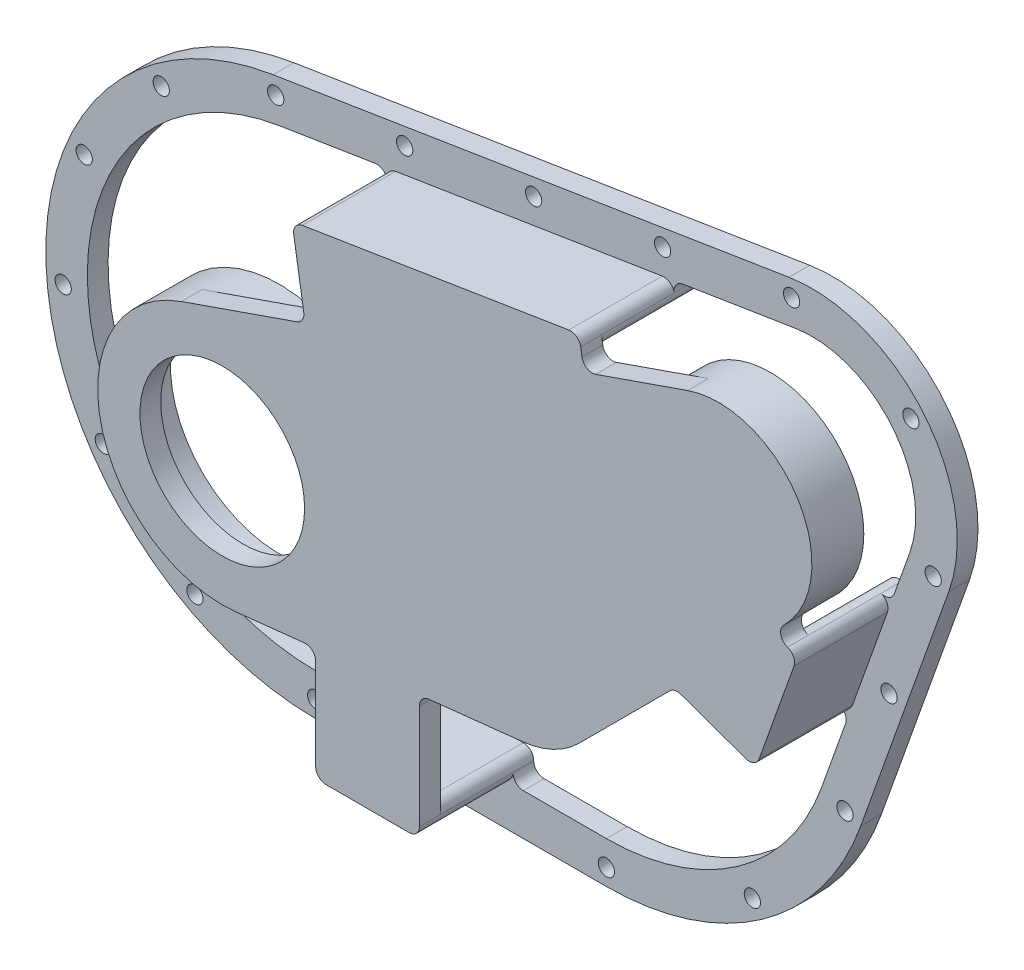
ISO-10303-21;
HEADER;
FILE_DESCRIPTION(('STEP AP214'),'2;1');
FILE_NAME('part.step','',(''),(''),'','','');
FILE_SCHEMA(('AUTOMOTIVE_DESIGN { 1 0 10303 214 1 1 1 1 }'));
ENDSEC;
DATA;
#1=APPLICATION_CONTEXT('core data for automotive mechanical design processes');
#2=APPLICATION_PROTOCOL_DEFINITION('international standard','automotive_design',2000,#1);
#3=PRODUCT_CONTEXT('',#1,'mechanical');
#4=PRODUCT('Part','Part','',(#3));
#5=PRODUCT_RELATED_PRODUCT_CATEGORY('part','',(#4));
#6=PRODUCT_DEFINITION_FORMATION('','',#4);
#7=PRODUCT_DEFINITION_CONTEXT('part definition',#1,'design');
#8=PRODUCT_DEFINITION('design','',#6,#7);
#9=PRODUCT_DEFINITION_SHAPE('','',#8);
#10=(LENGTH_UNIT() NAMED_UNIT(*) SI_UNIT(.MILLI.,.METRE.));
#11=(NAMED_UNIT(*) PLANE_ANGLE_UNIT() SI_UNIT($,.RADIAN.));
#12=(NAMED_UNIT(*) SI_UNIT($,.STERADIAN.) SOLID_ANGLE_UNIT());
#13=UNCERTAINTY_MEASURE_WITH_UNIT(LENGTH_MEASURE(1.E-05),#10,'distance_accuracy_value','');
#14=(GEOMETRIC_REPRESENTATION_CONTEXT(3) GLOBAL_UNCERTAINTY_ASSIGNED_CONTEXT((#13)) GLOBAL_UNIT_ASSIGNED_CONTEXT((#10,
#11,#12)) REPRESENTATION_CONTEXT('',''));
#15=CARTESIAN_POINT('',(0.,0.,0.));
#16=DIRECTION('',(0.,0.,1.));
#17=DIRECTION('',(1.,0.,0.));
#18=AXIS2_PLACEMENT_3D('',#15,#16,#17);
#19=CARTESIAN_POINT('',(0.,-69.85,6.35));
#20=DIRECTION('',(0.,1.,0.));
#21=DIRECTION('',(0.,0.,1.));
#22=AXIS2_PLACEMENT_3D('',#19,#20,#21);
#23=PLANE('',#22);
#24=DIRECTION('',(-1.,0.,0.));
#25=VECTOR('',#24,1.);
#26=CARTESIAN_POINT('',(88.9,-69.85,-22.225));
#27=LINE('',#26,#25);
#28=CARTESIAN_POINT('',(57.15,-69.85,-22.225));
#29=VERTEX_POINT('',#28);
#30=CARTESIAN_POINT('',(31.75,-69.85,-22.225));
#31=VERTEX_POINT('',#30);
#32=EDGE_CURVE('E460',#29,#31,#27,.T.);
#33=ORIENTED_EDGE('',*,*,#32,.F.);
#34=DIRECTION('',(0.,0.,-1.));
#35=VECTOR('',#34,1.);
#36=CARTESIAN_POINT('',(57.15,-69.85,6.35));
#37=LINE('',#36,#35);
#38=CARTESIAN_POINT('',(57.15,-69.85,6.35));
#39=VERTEX_POINT('',#38);
#40=EDGE_CURVE('E838',#29,#39,#37,.F.);
#41=ORIENTED_EDGE('',*,*,#40,.T.);
#42=DIRECTION('',(1.,0.,0.));
#43=VECTOR('',#42,1.);
#44=CARTESIAN_POINT('',(0.,-69.85,6.35));
#45=LINE('',#44,#43);
#46=CARTESIAN_POINT('',(31.75,-69.85,6.35));
#47=VERTEX_POINT('',#46);
#48=EDGE_CURVE('E588',#47,#39,#45,.T.);
#49=ORIENTED_EDGE('',*,*,#48,.F.);
#50=DIRECTION('',(0.,0.,-1.));
#51=VECTOR('',#50,1.);
#52=CARTESIAN_POINT('',(31.75,-69.85,-22.225));
#53=LINE('',#52,#51);
#54=EDGE_CURVE('E835',#47,#31,#53,.T.);
#55=ORIENTED_EDGE('',*,*,#54,.T.);
#56=EDGE_LOOP('',(#33,#41,#49,#55));
#57=FACE_BOUND('',#56,.T.);
#58=ADVANCED_FACE('F35',(#57),#23,.F.);
#59=CARTESIAN_POINT('',(144.666925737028,-51.5792100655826,6.35));
#60=DIRECTION('',(-0.941922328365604,0.335830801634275,0.));
#61=DIRECTION('',(-0.335830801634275,-0.941922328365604,0.));
#62=AXIS2_PLACEMENT_3D('',#59,#60,#61);
#63=PLANE('',#62);
#64=DIRECTION('',(0.335830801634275,0.941922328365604,0.));
#65=VECTOR('',#64,1.);
#66=CARTESIAN_POINT('',(144.666925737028,-51.5792100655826,6.35));
#67=LINE('',#66,#65);
#68=CARTESIAN_POINT('',(164.181116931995,3.15326925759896,6.35));
#69=VERTEX_POINT('',#68);
#70=CARTESIAN_POINT('',(174.843744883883,33.0593031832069,6.35));
#71=VERTEX_POINT('',#70);
#72=EDGE_CURVE('E604',#69,#71,#67,.T.);
#73=ORIENTED_EDGE('',*,*,#72,.F.);
#74=DIRECTION('',(0.,0.,-1.));
#75=VECTOR('',#74,1.);
#76=CARTESIAN_POINT('',(164.181116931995,3.15326925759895,-22.225));
#77=LINE('',#76,#75);
#78=CARTESIAN_POINT('',(164.181116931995,3.15326925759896,-22.225));
#79=VERTEX_POINT('',#78);
#80=EDGE_CURVE('E810',#69,#79,#77,.T.);
#81=ORIENTED_EDGE('',*,*,#80,.T.);
#82=DIRECTION('',(-0.335830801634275,-0.941922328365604,0.));
#83=VECTOR('',#82,1.);
#84=CARTESIAN_POINT('',(181.667826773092,52.1991648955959,-22.225));
#85=LINE('',#84,#83);
#86=CARTESIAN_POINT('',(174.843744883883,33.0593031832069,-22.225));
#87=VERTEX_POINT('',#86);
#88=EDGE_CURVE('E435',#87,#79,#85,.T.);
#89=ORIENTED_EDGE('',*,*,#88,.F.);
#90=DIRECTION('',(0.,0.,-1.));
#91=VECTOR('',#90,1.);
#92=CARTESIAN_POINT('',(174.843744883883,33.0593031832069,6.35));
#93=LINE('',#92,#91);
#94=EDGE_CURVE('E790',#87,#71,#93,.F.);
#95=ORIENTED_EDGE('',*,*,#94,.T.);
#96=EDGE_LOOP('',(#73,#81,#89,#95));
#97=FACE_BOUND('',#96,.T.);
#98=ADVANCED_FACE('F1067',(#97),#63,.F.);
#99=CARTESIAN_POINT('',(-11.0336365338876,68.9730481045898,6.35));
#100=DIRECTION('',(-0.15796186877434,0.987445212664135,0.));
#101=DIRECTION('',(-0.987445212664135,-0.15796186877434,0.));
#102=AXIS2_PLACEMENT_3D('',#99,#100,#101);
#103=PLANE('',#102);
#104=DIRECTION('',(0.987445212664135,0.15796186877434,0.));
#105=VECTOR('',#104,1.);
#106=CARTESIAN_POINT('',(146.746503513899,94.2131783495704,-22.225));
#107=LINE('',#106,#105);
#108=CARTESIAN_POINT('',(24.4761000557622,74.6535499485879,-22.225));
#109=VERTEX_POINT('',#108);
#110=CARTESIAN_POINT('',(105.989702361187,87.6933022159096,-22.225));
#111=VERTEX_POINT('',#110);
#112=EDGE_CURVE('E464',#109,#111,#107,.T.);
#113=ORIENTED_EDGE('',*,*,#112,.F.);
#114=DIRECTION('',(0.,0.,-1.));
#115=VECTOR('',#114,1.);
#116=CARTESIAN_POINT('',(24.4761000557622,74.6535499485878,6.35));
#117=LINE('',#116,#115);
#118=CARTESIAN_POINT('',(24.4761000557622,74.6535499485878,6.35));
#119=VERTEX_POINT('',#118);
#120=EDGE_CURVE('E853',#109,#119,#117,.F.);
#121=ORIENTED_EDGE('',*,*,#120,.T.);
#122=DIRECTION('',(0.987445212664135,0.15796186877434,0.));
#123=VECTOR('',#122,1.);
#124=CARTESIAN_POINT('',(-11.0336365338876,68.9730481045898,6.35));
#125=LINE('',#124,#123);
#126=CARTESIAN_POINT('',(105.989702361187,87.6933022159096,6.35));
#127=VERTEX_POINT('',#126);
#128=EDGE_CURVE('E620',#119,#127,#125,.T.);
#129=ORIENTED_EDGE('',*,*,#128,.T.);
#130=DIRECTION('',(0.,0.,-1.));
#131=VECTOR('',#130,1.);
#132=CARTESIAN_POINT('',(105.989702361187,87.6933022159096,6.35));
#133=LINE('',#132,#131);
#134=EDGE_CURVE('E850',#127,#111,#133,.T.);
#135=ORIENTED_EDGE('',*,*,#134,.T.);
#136=EDGE_LOOP('',(#113,#121,#129,#135));
#137=FACE_BOUND('',#136,.T.);
#138=ADVANCED_FACE('F1073',(#137),#103,.T.);
#139=CARTESIAN_POINT('',(0.,0.,0.));
#140=DIRECTION('',(0.,0.,1.));
#141=DIRECTION('',(1.,0.,0.));
#142=AXIS2_PLACEMENT_3D('',#139,#140,#141);
#143=PLANE('',#142);
#144=DIRECTION('',(1.,0.,0.));
#145=VECTOR('',#144,1.);
#146=CARTESIAN_POINT('',(28.575,-63.5,0.));
#147=LINE('',#146,#145);
#148=CARTESIAN_POINT('',(31.75,-63.5,0.));
#149=VERTEX_POINT('',#148);
#150=CARTESIAN_POINT('',(57.15,-63.5,0.));
#151=VERTEX_POINT('',#150);
#152=EDGE_CURVE('E530',#149,#151,#147,.T.);
#153=ORIENTED_EDGE('',*,*,#152,.F.);
#154=CARTESIAN_POINT('',(31.75,-66.675,0.));
#155=DIRECTION('',(0.,0.,1.));
#156=DIRECTION('',(1.,0.,0.));
#157=AXIS2_PLACEMENT_3D('',#154,#155,#156);
#158=CIRCLE('',#157,3.175);
#159=CARTESIAN_POINT('',(28.575,-66.675,0.));
#160=VERTEX_POINT('',#159);
#161=EDGE_CURVE('E774',#149,#160,#158,.T.);
#162=ORIENTED_EDGE('',*,*,#161,.T.);
#163=DIRECTION('',(0.,1.,0.));
#164=VECTOR('',#163,1.);
#165=CARTESIAN_POINT('',(28.575,0.,0.));
#166=LINE('',#165,#164);
#167=CARTESIAN_POINT('',(28.575,-38.7767847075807,0.));
#168=VERTEX_POINT('',#167);
#169=EDGE_CURVE('E635',#160,#168,#166,.T.);
#170=ORIENTED_EDGE('',*,*,#169,.T.);
#171=CARTESIAN_POINT('',(25.4,-38.7767847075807,0.));
#172=DIRECTION('',(0.,0.,1.));
#173=DIRECTION('',(1.,0.,0.));
#174=AXIS2_PLACEMENT_3D('',#171,#172,#173);
#175=CIRCLE('',#174,3.175);
#176=CARTESIAN_POINT('',(25.0598214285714,-35.6200611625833,0.));
#177=VERTEX_POINT('',#176);
#178=EDGE_CURVE('E903',#168,#177,#175,.T.);
#179=ORIENTED_EDGE('',*,*,#178,.T.);
#180=DIRECTION('',(0.994243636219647,0.107142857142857,0.));
#181=VECTOR('',#180,1.);
#182=CARTESIAN_POINT('',(4.08214285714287,-37.8806825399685,0.));
#183=LINE('',#182,#181);
#184=CARTESIAN_POINT('',(4.08214285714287,-37.8806825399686,0.));
#185=VERTEX_POINT('',#184);
#186=EDGE_CURVE('E632',#185,#177,#183,.T.);
#187=ORIENTED_EDGE('',*,*,#186,.F.);
#188=CARTESIAN_POINT('',(0.,0.,0.));
#189=DIRECTION('',(0.,0.,1.));
#190=DIRECTION('',(1.,0.,0.));
#191=AXIS2_PLACEMENT_3D('',#188,#189,#190);
#192=CIRCLE('',#191,38.1);
#193=CARTESIAN_POINT('',(-12.5146351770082,35.9860237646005,0.));
#194=VERTEX_POINT('',#193);
#195=EDGE_CURVE('E695',#185,#194,#192,.T.);
#196=ORIENTED_EDGE('',*,*,#195,.T.);
#197=DIRECTION('',(0.944515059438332,0.328468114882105,0.));
#198=VECTOR('',#197,1.);
#199=CARTESIAN_POINT('',(-12.5146351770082,35.9860237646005,0.));
#200=LINE('',#199,#198);
#201=CARTESIAN_POINT('',(22.8280028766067,48.2769127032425,0.));
#202=VERTEX_POINT('',#201);
#203=EDGE_CURVE('E575',#194,#202,#200,.T.);
#204=ORIENTED_EDGE('',*,*,#203,.T.);
#205=CARTESIAN_POINT('',(21.7851166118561,51.2757480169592,0.));
#206=DIRECTION('',(0.,0.,1.));
#207=DIRECTION('',(1.,0.,0.));
#208=AXIS2_PLACEMENT_3D('',#205,#206,#207);
#209=CIRCLE('',#208,3.175);
#210=CARTESIAN_POINT('',(24.9202551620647,51.7772769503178,0.));
#211=VERTEX_POINT('',#210);
#212=EDGE_CURVE('E59',#202,#211,#209,.T.);
#213=ORIENTED_EDGE('',*,*,#212,.T.);
#214=DIRECTION('',(0.15796186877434,-0.987445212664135,0.));
#215=VECTOR('',#214,1.);
#216=CARTESIAN_POINT('',(32.3745980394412,5.1789729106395,0.));
#217=LINE('',#216,#215);
#218=CARTESIAN_POINT('',(21.8424904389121,71.0168824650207,0.));
#219=VERTEX_POINT('',#218);
#220=EDGE_CURVE('E658',#219,#211,#217,.T.);
#221=ORIENTED_EDGE('',*,*,#220,.F.);
#222=CARTESIAN_POINT('',(24.9776289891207,71.5184113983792,0.));
#223=DIRECTION('',(0.,0.,1.));
#224=DIRECTION('',(1.,0.,0.));
#225=AXIS2_PLACEMENT_3D('',#222,#223,#224);
#226=CIRCLE('',#225,3.175);
#227=CARTESIAN_POINT('',(25.4791579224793,68.3832728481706,0.));
#228=VERTEX_POINT('',#227);
#229=EDGE_CURVE('E755',#219,#228,#226,.T.);
#230=ORIENTED_EDGE('',*,*,#229,.T.);
#231=DIRECTION('',(-0.987445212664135,-0.157961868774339,0.));
#232=VECTOR('',#231,1.);
#233=CARTESIAN_POINT('',(22.3440193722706,67.881743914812,0.));
#234=LINE('',#233,#232);
#235=CARTESIAN_POINT('',(106.992760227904,81.4230251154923,0.));
#236=VERTEX_POINT('',#235);
#237=EDGE_CURVE('E549',#236,#228,#234,.T.);
#238=ORIENTED_EDGE('',*,*,#237,.F.);
#239=CARTESIAN_POINT('',(106.491231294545,84.5581636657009,0.));
#240=DIRECTION('',(0.,0.,1.));
#241=DIRECTION('',(1.,0.,0.));
#242=AXIS2_PLACEMENT_3D('',#239,#240,#241);
#243=CIRCLE('',#242,3.175);
#244=CARTESIAN_POINT('',(109.626369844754,85.0596925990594,0.));
#245=VERTEX_POINT('',#244);
#246=EDGE_CURVE('E761',#236,#245,#243,.T.);
#247=ORIENTED_EDGE('',*,*,#246,.T.);
#248=DIRECTION('',(0.15796186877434,-0.987445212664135,0.));
#249=VECTOR('',#248,1.);
#250=CARTESIAN_POINT('',(120.158477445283,19.2217830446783,0.));
#251=LINE('',#250,#249);
#252=CARTESIAN_POINT('',(110.02752314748,82.5520183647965,0.));
#253=VERTEX_POINT('',#252);
#254=EDGE_CURVE('E656',#245,#253,#251,.T.);
#255=ORIENTED_EDGE('',*,*,#254,.T.);
#256=CARTESIAN_POINT('',(113.162661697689,83.053547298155,0.));
#257=DIRECTION('',(0.,0.,1.));
#258=DIRECTION('',(1.,0.,0.));
#259=AXIS2_PLACEMENT_3D('',#256,#257,#258);
#260=CIRCLE('',#259,3.175);
#261=CARTESIAN_POINT('',(114.205547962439,80.0547119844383,0.));
#262=VERTEX_POINT('',#261);
#263=EDGE_CURVE('E44',#253,#262,#260,.T.);
#264=ORIENTED_EDGE('',*,*,#263,.T.);
#265=DIRECTION('',(0.944515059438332,0.328468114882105,0.));
#266=VECTOR('',#265,1.);
#267=CARTESIAN_POINT('',(-12.5146351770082,35.9860237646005,0.));
#268=LINE('',#267,#266);
#269=CARTESIAN_POINT('',(142.375816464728,89.8513106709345,0.));
#270=VERTEX_POINT('',#269);
#271=EDGE_CURVE('E654',#262,#270,#268,.T.);
#272=ORIENTED_EDGE('',*,*,#271,.T.);
#273=CARTESIAN_POINT('',(151.761792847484,62.8617928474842,0.));
#274=DIRECTION('',(0.,0.,1.));
#275=DIRECTION('',(1.,0.,0.));
#276=AXIS2_PLACEMENT_3D('',#273,#274,#275);
#277=CIRCLE('',#276,28.575);
#278=CARTESIAN_POINT('',(171.96736911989,42.6562165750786,0.));
#279=VERTEX_POINT('',#278);
#280=EDGE_CURVE('E683',#270,#279,#277,.T.);
#281=ORIENTED_EDGE('',*,*,#280,.T.);
#282=DIRECTION('',(0.707106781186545,0.70710678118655,0.));
#283=VECTOR('',#282,1.);
#284=CARTESIAN_POINT('',(64.6555762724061,-64.6555762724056,0.));
#285=LINE('',#284,#283);
#286=CARTESIAN_POINT('',(171.683388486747,42.3722359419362,0.));
#287=VERTEX_POINT('',#286);
#288=EDGE_CURVE('E652',#287,#279,#285,.T.);
#289=ORIENTED_EDGE('',*,*,#288,.F.);
#290=CARTESIAN_POINT('',(173.928452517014,40.1271719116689,0.));
#291=DIRECTION('',(0.,0.,1.));
#292=DIRECTION('',(1.,0.,0.));
#293=AXIS2_PLACEMENT_3D('',#290,#291,#292);
#294=CIRCLE('',#293,3.175);
#295=CARTESIAN_POINT('',(172.862189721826,37.1365685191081,0.));
#296=VERTEX_POINT('',#295);
#297=EDGE_CURVE('E891',#287,#296,#294,.T.);
#298=ORIENTED_EDGE('',*,*,#297,.T.);
#299=DIRECTION('',(-0.941922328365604,0.335830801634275,0.));
#300=VECTOR('',#299,1.);
#301=CARTESIAN_POINT('',(31.2430819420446,87.6291166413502,0.));
#302=LINE('',#301,#300);
#303=CARTESIAN_POINT('',(172.919404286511,37.1161693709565,0.));
#304=VERTEX_POINT('',#303);
#305=EDGE_CURVE('E649',#304,#296,#302,.T.);
#306=ORIENTED_EDGE('',*,*,#305,.F.);
#307=CARTESIAN_POINT('',(171.853141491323,34.1255659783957,0.));
#308=DIRECTION('',(0.,0.,1.));
#309=DIRECTION('',(1.,0.,0.));
#310=AXIS2_PLACEMENT_3D('',#307,#308,#309);
#311=CIRCLE('',#310,3.175);
#312=CARTESIAN_POINT('',(168.862538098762,35.1918287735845,0.));
#313=VERTEX_POINT('',#312);
#314=EDGE_CURVE('E777',#304,#313,#311,.T.);
#315=ORIENTED_EDGE('',*,*,#314,.T.);
#316=DIRECTION('',(0.335830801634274,0.941922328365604,0.));
#317=VECTOR('',#316,1.);
#318=CARTESIAN_POINT('',(157.133647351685,2.2951914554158,0.));
#319=LINE('',#318,#317);
#320=CARTESIAN_POINT('',(158.199910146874,5.28579484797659,0.));
#321=VERTEX_POINT('',#320);
#322=EDGE_CURVE('E543',#321,#313,#319,.T.);
#323=ORIENTED_EDGE('',*,*,#322,.F.);
#324=CARTESIAN_POINT('',(161.190513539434,4.21953205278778,0.));
#325=DIRECTION('',(0.,0.,1.));
#326=DIRECTION('',(1.,0.,0.));
#327=AXIS2_PLACEMENT_3D('',#324,#325,#326);
#328=CIRCLE('',#327,3.175);
#329=CARTESIAN_POINT('',(160.124250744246,1.22892866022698,0.));
#330=VERTEX_POINT('',#329);
#331=EDGE_CURVE('E779',#321,#330,#328,.T.);
#332=ORIENTED_EDGE('',*,*,#331,.T.);
#333=DIRECTION('',(-0.941922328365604,0.335830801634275,0.));
#334=VECTOR('',#333,1.);
#335=CARTESIAN_POINT('',(18.4479283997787,51.7418759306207,0.));
#336=LINE('',#335,#334);
#337=CARTESIAN_POINT('',(140.20708775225,8.33014774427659,0.));
#338=VERTEX_POINT('',#337);
#339=EDGE_CURVE('E646',#330,#338,#336,.T.);
#340=ORIENTED_EDGE('',*,*,#339,.T.);
#341=CARTESIAN_POINT('',(139.140824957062,5.3395443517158,0.));
#342=DIRECTION('',(0.,0.,1.));
#343=DIRECTION('',(1.,0.,0.));
#344=AXIS2_PLACEMENT_3D('',#341,#342,#343);
#345=CIRCLE('',#344,3.175);
#346=CARTESIAN_POINT('',(136.895760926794,7.58460838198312,0.));
#347=VERTEX_POINT('',#346);
#348=EDGE_CURVE('E895',#338,#347,#345,.T.);
#349=ORIENTED_EDGE('',*,*,#348,.T.);
#350=DIRECTION('',(0.707106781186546,0.707106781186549,0.));
#351=VECTOR('',#350,1.);
#352=CARTESIAN_POINT('',(64.6555762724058,-64.6555762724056,0.));
#353=LINE('',#352,#351);
#354=CARTESIAN_POINT('',(109.105576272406,-20.2055762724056,0.));
#355=VERTEX_POINT('',#354);
#356=EDGE_CURVE('E643',#355,#347,#353,.T.);
#357=ORIENTED_EDGE('',*,*,#356,.F.);
#358=CARTESIAN_POINT('',(88.9,0.,0.));
#359=DIRECTION('',(0.,0.,1.));
#360=DIRECTION('',(1.,0.,0.));
#361=AXIS2_PLACEMENT_3D('',#358,#359,#360);
#362=CIRCLE('',#361,28.575);
#363=CARTESIAN_POINT('',(91.9616071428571,-28.4105119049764,0.));
#364=VERTEX_POINT('',#363);
#365=EDGE_CURVE('E689',#355,#364,#362,.T.);
#366=ORIENTED_EDGE('',*,*,#365,.T.);
#367=DIRECTION('',(0.994243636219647,0.107142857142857,0.));
#368=VECTOR('',#367,1.);
#369=CARTESIAN_POINT('',(4.08214285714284,-37.8806825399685,0.));
#370=LINE('',#369,#368);
#371=CARTESIAN_POINT('',(63.1598214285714,-31.5142839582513,0.));
#372=VERTEX_POINT('',#371);
#373=EDGE_CURVE('E641',#372,#364,#370,.T.);
#374=ORIENTED_EDGE('',*,*,#373,.F.);
#375=CARTESIAN_POINT('',(63.5,-34.6710075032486,0.));
#376=DIRECTION('',(0.,0.,1.));
#377=DIRECTION('',(1.,0.,0.));
#378=AXIS2_PLACEMENT_3D('',#375,#376,#377);
#379=CIRCLE('',#378,3.175);
#380=CARTESIAN_POINT('',(60.325,-34.6710075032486,0.));
#381=VERTEX_POINT('',#380);
#382=EDGE_CURVE('E899',#372,#381,#379,.T.);
#383=ORIENTED_EDGE('',*,*,#382,.T.);
#384=DIRECTION('',(0.,1.,0.));
#385=VECTOR('',#384,1.);
#386=CARTESIAN_POINT('',(60.325,0.,0.));
#387=LINE('',#386,#385);
#388=CARTESIAN_POINT('',(60.325,-66.675,0.));
#389=VERTEX_POINT('',#388);
#390=EDGE_CURVE('E638',#389,#381,#387,.T.);
#391=ORIENTED_EDGE('',*,*,#390,.F.);
#392=CARTESIAN_POINT('',(57.15,-66.675,0.));
#393=DIRECTION('',(0.,0.,1.));
#394=DIRECTION('',(1.,0.,0.));
#395=AXIS2_PLACEMENT_3D('',#392,#393,#394);
#396=CIRCLE('',#395,3.175);
#397=EDGE_CURVE('E764',#389,#151,#396,.T.);
#398=ORIENTED_EDGE('',*,*,#397,.T.);
#399=EDGE_LOOP('',(#153,#162,#170,#179,#187,#196,#204,#213,#221,#230,#238,#247,#255,#264,#272,
#281,#289,#298,#306,#315,#323,#332,#340,#349,#357,#366,#374,#383,#391,#398));
#400=FACE_BOUND('',#399,.T.);
#401=ADVANCED_FACE('F1210',(#400),#143,.F.);
#402=CARTESIAN_POINT('',(0.,0.,0.));
#403=DIRECTION('',(0.,0.,1.));
#404=DIRECTION('',(1.,0.,0.));
#405=AXIS2_PLACEMENT_3D('',#402,#403,#404);
#406=CIRCLE('',#405,25.1841);
#407=CARTESIAN_POINT('',(25.1841,0.,0.));
#408=VERTEX_POINT('',#407);
#409=EDGE_CURVE('E580',#408,#408,#406,.T.);
#410=ORIENTED_EDGE('',*,*,#409,.T.);
#411=EDGE_LOOP('',(#410));
#412=FACE_BOUND('',#411,.T.);
#413=CARTESIAN_POINT('',(0.,0.,0.));
#414=DIRECTION('',(0.,0.,1.));
#415=DIRECTION('',(1.,0.,0.));
#416=AXIS2_PLACEMENT_3D('',#413,#414,#415);
#417=CIRCLE('',#416,33.3375);
#418=CARTESIAN_POINT('',(33.3375,0.,0.));
#419=VERTEX_POINT('',#418);
#420=EDGE_CURVE('E692',#419,#419,#417,.T.);
#421=ORIENTED_EDGE('',*,*,#420,.F.);
#422=EDGE_LOOP('',(#421));
#423=FACE_BOUND('',#422,.T.);
#424=ADVANCED_FACE('F1096',(#412,#423),#143,.F.);
#425=CARTESIAN_POINT('',(-12.5146351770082,35.9860237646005,6.35));
#426=DIRECTION('',(-0.328468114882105,0.944515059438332,0.));
#427=DIRECTION('',(-0.944515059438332,-0.328468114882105,0.));
#428=AXIS2_PLACEMENT_3D('',#425,#426,#427);
#429=PLANE('',#428);
#430=DIRECTION('',(0.944515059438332,0.328468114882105,0.));
#431=VECTOR('',#430,1.);
#432=CARTESIAN_POINT('',(-12.5146351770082,35.9860237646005,6.35));
#433=LINE('',#432,#431);
#434=CARTESIAN_POINT('',(-12.5146351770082,35.9860237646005,6.35));
#435=VERTEX_POINT('',#434);
#436=CARTESIAN_POINT('',(22.8280028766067,48.2769127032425,6.35));
#437=VERTEX_POINT('',#436);
#438=EDGE_CURVE('E576',#435,#437,#433,.T.);
#439=ORIENTED_EDGE('',*,*,#438,.T.);
#440=DIRECTION('',(0.,0.,-1.));
#441=VECTOR('',#440,1.);
#442=CARTESIAN_POINT('',(22.8280028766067,48.2769127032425,6.35));
#443=LINE('',#442,#441);
#444=EDGE_CURVE('E875',#437,#202,#443,.T.);
#445=ORIENTED_EDGE('',*,*,#444,.T.);
#446=ORIENTED_EDGE('',*,*,#203,.F.);
#447=DIRECTION('',(0.,0.,-1.));
#448=VECTOR('',#447,1.);
#449=CARTESIAN_POINT('',(-12.5146351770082,35.9860237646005,6.35));
#450=LINE('',#449,#448);
#451=EDGE_CURVE('E677',#435,#194,#450,.T.);
#452=ORIENTED_EDGE('',*,*,#451,.F.);
#453=EDGE_LOOP('',(#439,#445,#446,#452));
#454=FACE_BOUND('',#453,.T.);
#455=ADVANCED_FACE('F1092',(#454),#429,.T.);
#456=CARTESIAN_POINT('',(0.,0.,6.35));
#457=DIRECTION('',(0.,0.,-1.));
#458=DIRECTION('',(-1.,0.,0.));
#459=AXIS2_PLACEMENT_3D('',#456,#457,#458);
#460=CYLINDRICAL_SURFACE('',#459,38.1);
#461=ORIENTED_EDGE('',*,*,#451,.T.);
#462=ORIENTED_EDGE('',*,*,#195,.F.);
#463=DIRECTION('',(0.,0.,-1.));
#464=VECTOR('',#463,1.);
#465=CARTESIAN_POINT('',(4.08214285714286,-37.8806825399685,6.35));
#466=LINE('',#465,#464);
#467=CARTESIAN_POINT('',(4.08214285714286,-37.8806825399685,6.35));
#468=VERTEX_POINT('',#467);
#469=EDGE_CURVE('E674',#468,#185,#466,.T.);
#470=ORIENTED_EDGE('',*,*,#469,.F.);
#471=CARTESIAN_POINT('',(0.,0.,6.35));
#472=DIRECTION('',(0.,0.,1.));
#473=DIRECTION('',(1.,0.,0.));
#474=AXIS2_PLACEMENT_3D('',#471,#472,#473);
#475=CIRCLE('',#474,38.1);
#476=EDGE_CURVE('E579',#435,#468,#475,.T.);
#477=ORIENTED_EDGE('',*,*,#476,.F.);
#478=EDGE_LOOP('',(#461,#462,#470,#477));
#479=FACE_BOUND('',#478,.T.);
#480=CARTESIAN_POINT('',(0.,0.,-11.1125));
#481=DIRECTION('',(0.,0.,1.));
#482=DIRECTION('',(1.,0.,0.));
#483=AXIS2_PLACEMENT_3D('',#480,#481,#482);
#484=CIRCLE('',#483,38.1);
#485=CARTESIAN_POINT('',(38.1,0.,-11.1125));
#486=VERTEX_POINT('',#485);
#487=EDGE_CURVE('E560',#486,#486,#484,.T.);
#488=ORIENTED_EDGE('',*,*,#487,.T.);
#489=EDGE_LOOP('',(#488));
#490=FACE_BOUND('',#489,.T.);
#491=ADVANCED_FACE('F1088',(#479,#490),#460,.T.);
#492=CARTESIAN_POINT('',(4.08214285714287,-37.8806825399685,6.35));
#493=DIRECTION('',(-0.107142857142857,0.994243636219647,0.));
#494=DIRECTION('',(-0.994243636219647,-0.107142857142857,0.));
#495=AXIS2_PLACEMENT_3D('',#492,#493,#494);
#496=PLANE('',#495);
#497=ORIENTED_EDGE('',*,*,#186,.T.);
#498=DIRECTION('',(0.,0.,-1.));
#499=VECTOR('',#498,1.);
#500=CARTESIAN_POINT('',(25.0598214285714,-35.6200611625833,6.35));
#501=LINE('',#500,#499);
#502=CARTESIAN_POINT('',(25.0598214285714,-35.6200611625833,6.35));
#503=VERTEX_POINT('',#502);
#504=EDGE_CURVE('E873',#177,#503,#501,.F.);
#505=ORIENTED_EDGE('',*,*,#504,.T.);
#506=DIRECTION('',(0.994243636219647,0.107142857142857,0.));
#507=VECTOR('',#506,1.);
#508=CARTESIAN_POINT('',(4.08214285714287,-37.8806825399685,6.35));
#509=LINE('',#508,#507);
#510=EDGE_CURVE('E582',#468,#503,#509,.T.);
#511=ORIENTED_EDGE('',*,*,#510,.F.);
#512=ORIENTED_EDGE('',*,*,#469,.T.);
#513=EDGE_LOOP('',(#497,#505,#511,#512));
#514=FACE_BOUND('',#513,.T.);
#515=ADVANCED_FACE('F1084',(#514),#496,.F.);
#516=CARTESIAN_POINT('',(28.575,0.,6.35));
#517=DIRECTION('',(-1.,0.,0.));
#518=DIRECTION('',(0.,0.,1.));
#519=AXIS2_PLACEMENT_3D('',#516,#517,#518);
#520=PLANE('',#519);
#521=ORIENTED_EDGE('',*,*,#169,.F.);
#522=DIRECTION('',(0.,0.,-1.));
#523=VECTOR('',#522,1.);
#524=CARTESIAN_POINT('',(28.575,-66.675,6.35));
#525=LINE('',#524,#523);
#526=CARTESIAN_POINT('',(28.575,-66.675,6.35));
#527=VERTEX_POINT('',#526);
#528=EDGE_CURVE('E843',#160,#527,#525,.F.);
#529=ORIENTED_EDGE('',*,*,#528,.T.);
#530=DIRECTION('',(0.,1.,0.));
#531=VECTOR('',#530,1.);
#532=CARTESIAN_POINT('',(28.575,0.,6.35));
#533=LINE('',#532,#531);
#534=CARTESIAN_POINT('',(28.575,-38.7767847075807,6.35));
#535=VERTEX_POINT('',#534);
#536=EDGE_CURVE('E585',#527,#535,#533,.T.);
#537=ORIENTED_EDGE('',*,*,#536,.T.);
#538=DIRECTION('',(0.,0.,-1.));
#539=VECTOR('',#538,1.);
#540=CARTESIAN_POINT('',(28.575,-38.7767847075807,6.35));
#541=LINE('',#540,#539);
#542=EDGE_CURVE('E840',#535,#168,#541,.T.);
#543=ORIENTED_EDGE('',*,*,#542,.T.);
#544=EDGE_LOOP('',(#521,#529,#537,#543));
#545=FACE_BOUND('',#544,.T.);
#546=ADVANCED_FACE('F1081',(#545),#520,.T.);
#547=CARTESIAN_POINT('',(60.325,0.,6.35));
#548=DIRECTION('',(-1.,0.,0.));
#549=DIRECTION('',(0.,0.,1.));
#550=AXIS2_PLACEMENT_3D('',#547,#548,#549);
#551=PLANE('',#550);
#552=DIRECTION('',(0.,1.,0.));
#553=VECTOR('',#552,1.);
#554=CARTESIAN_POINT('',(60.325,0.,6.35));
#555=LINE('',#554,#553);
#556=CARTESIAN_POINT('',(60.325,-66.675,6.35));
#557=VERTEX_POINT('',#556);
#558=CARTESIAN_POINT('',(60.325,-34.6710075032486,6.35));
#559=VERTEX_POINT('',#558);
#560=EDGE_CURVE('E591',#557,#559,#555,.T.);
#561=ORIENTED_EDGE('',*,*,#560,.F.);
#562=DIRECTION('',(0.,0.,-1.));
#563=VECTOR('',#562,1.);
#564=CARTESIAN_POINT('',(60.325,-66.675,6.35));
#565=LINE('',#564,#563);
#566=EDGE_CURVE('E832',#557,#389,#565,.T.);
#567=ORIENTED_EDGE('',*,*,#566,.T.);
#568=ORIENTED_EDGE('',*,*,#390,.T.);
#569=DIRECTION('',(0.,0.,-1.));
#570=VECTOR('',#569,1.);
#571=CARTESIAN_POINT('',(60.325,-34.6710075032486,6.35));
#572=LINE('',#571,#570);
#573=EDGE_CURVE('E830',#381,#559,#572,.F.);
#574=ORIENTED_EDGE('',*,*,#573,.T.);
#575=EDGE_LOOP('',(#561,#567,#568,#574));
#576=FACE_BOUND('',#575,.T.);
#577=ADVANCED_FACE('F1079',(#576),#551,.F.);
#578=CARTESIAN_POINT('',(4.08214285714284,-37.8806825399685,6.35));
#579=DIRECTION('',(-0.107142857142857,0.994243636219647,0.));
#580=DIRECTION('',(-0.994243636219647,-0.107142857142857,0.));
#581=AXIS2_PLACEMENT_3D('',#578,#579,#580);
#582=PLANE('',#581);
#583=DIRECTION('',(0.994243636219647,0.107142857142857,0.));
#584=VECTOR('',#583,1.);
#585=CARTESIAN_POINT('',(4.08214285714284,-37.8806825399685,6.35));
#586=LINE('',#585,#584);
#587=CARTESIAN_POINT('',(63.1598214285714,-31.5142839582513,6.35));
#588=VERTEX_POINT('',#587);
#589=CARTESIAN_POINT('',(91.9616071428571,-28.4105119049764,6.35));
#590=VERTEX_POINT('',#589);
#591=EDGE_CURVE('E594',#588,#590,#586,.T.);
#592=ORIENTED_EDGE('',*,*,#591,.F.);
#593=DIRECTION('',(0.,0.,-1.));
#594=VECTOR('',#593,1.);
#595=CARTESIAN_POINT('',(63.1598214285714,-31.5142839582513,0.));
#596=LINE('',#595,#594);
#597=EDGE_CURVE('E870',#588,#372,#596,.T.);
#598=ORIENTED_EDGE('',*,*,#597,.T.);
#599=ORIENTED_EDGE('',*,*,#373,.T.);
#600=DIRECTION('',(0.,0.,-1.));
#601=VECTOR('',#600,1.);
#602=CARTESIAN_POINT('',(91.9616071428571,-28.4105119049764,6.35));
#603=LINE('',#602,#601);
#604=EDGE_CURVE('E671',#590,#364,#603,.T.);
#605=ORIENTED_EDGE('',*,*,#604,.F.);
#606=EDGE_LOOP('',(#592,#598,#599,#605));
#607=FACE_BOUND('',#606,.T.);
#608=ADVANCED_FACE('F1366',(#607),#582,.F.);
#609=CARTESIAN_POINT('',(88.9,0.,6.35));
#610=DIRECTION('',(0.,0.,-1.));
#611=DIRECTION('',(-1.,0.,0.));
#612=AXIS2_PLACEMENT_3D('',#609,#610,#611);
#613=CYLINDRICAL_SURFACE('',#612,28.575);
#614=ORIENTED_EDGE('',*,*,#604,.T.);
#615=ORIENTED_EDGE('',*,*,#365,.F.);
#616=DIRECTION('',(0.,0.,-1.));
#617=VECTOR('',#616,1.);
#618=CARTESIAN_POINT('',(109.105576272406,-20.2055762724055,6.35));
#619=LINE('',#618,#617);
#620=CARTESIAN_POINT('',(109.105576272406,-20.2055762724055,6.35));
#621=VERTEX_POINT('',#620);
#622=EDGE_CURVE('E668',#621,#355,#619,.T.);
#623=ORIENTED_EDGE('',*,*,#622,.F.);
#624=CARTESIAN_POINT('',(88.9,0.,6.35));
#625=DIRECTION('',(0.,0.,1.));
#626=DIRECTION('',(1.,0.,0.));
#627=AXIS2_PLACEMENT_3D('',#624,#625,#626);
#628=CIRCLE('',#627,28.575);
#629=EDGE_CURVE('E596',#590,#621,#628,.T.);
#630=ORIENTED_EDGE('',*,*,#629,.F.);
#631=EDGE_LOOP('',(#614,#615,#623,#630));
#632=FACE_BOUND('',#631,.T.);
#633=CARTESIAN_POINT('',(88.9,0.,-9.525));
#634=DIRECTION('',(0.,0.,1.));
#635=DIRECTION('',(1.,0.,0.));
#636=AXIS2_PLACEMENT_3D('',#633,#634,#635);
#637=CIRCLE('',#636,28.575);
#638=CARTESIAN_POINT('',(117.475,0.,-9.525));
#639=VERTEX_POINT('',#638);
#640=EDGE_CURVE('E566',#639,#639,#637,.T.);
#641=ORIENTED_EDGE('',*,*,#640,.T.);
#642=EDGE_LOOP('',(#641));
#643=FACE_BOUND('',#642,.T.);
#644=ADVANCED_FACE('F1363',(#632,#643),#613,.T.);
#645=CARTESIAN_POINT('',(64.6555762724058,-64.6555762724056,6.35));
#646=DIRECTION('',(-0.707106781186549,0.707106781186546,0.));
#647=DIRECTION('',(-0.707106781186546,-0.707106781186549,0.));
#648=AXIS2_PLACEMENT_3D('',#645,#646,#647);
#649=PLANE('',#648);
#650=ORIENTED_EDGE('',*,*,#356,.T.);
#651=DIRECTION('',(0.,0.,-1.));
#652=VECTOR('',#651,1.);
#653=CARTESIAN_POINT('',(136.895760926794,7.5846083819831,6.35));
#654=LINE('',#653,#652);
#655=CARTESIAN_POINT('',(136.895760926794,7.58460838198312,6.35));
#656=VERTEX_POINT('',#655);
#657=EDGE_CURVE('E868',#347,#656,#654,.F.);
#658=ORIENTED_EDGE('',*,*,#657,.T.);
#659=DIRECTION('',(0.707106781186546,0.707106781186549,0.));
#660=VECTOR('',#659,1.);
#661=CARTESIAN_POINT('',(64.6555762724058,-64.6555762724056,6.35));
#662=LINE('',#661,#660);
#663=EDGE_CURVE('E598',#621,#656,#662,.T.);
#664=ORIENTED_EDGE('',*,*,#663,.F.);
#665=ORIENTED_EDGE('',*,*,#622,.T.);
#666=EDGE_LOOP('',(#650,#658,#664,#665));
#667=FACE_BOUND('',#666,.T.);
#668=ADVANCED_FACE('F1359',(#667),#649,.F.);
#669=CARTESIAN_POINT('',(18.4479283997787,51.7418759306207,6.35));
#670=DIRECTION('',(-0.335830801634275,-0.941922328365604,0.));
#671=DIRECTION('',(0.941922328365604,-0.335830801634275,0.));
#672=AXIS2_PLACEMENT_3D('',#669,#670,#671);
#673=PLANE('',#672);
#674=ORIENTED_EDGE('',*,*,#339,.F.);
#675=DIRECTION('',(0.,0.,-1.));
#676=VECTOR('',#675,1.);
#677=CARTESIAN_POINT('',(160.124250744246,1.22892866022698,6.35));
#678=LINE('',#677,#676);
#679=CARTESIAN_POINT('',(160.124250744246,1.22892866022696,6.35));
#680=VERTEX_POINT('',#679);
#681=EDGE_CURVE('E816',#330,#680,#678,.F.);
#682=ORIENTED_EDGE('',*,*,#681,.T.);
#683=DIRECTION('',(-0.941922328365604,0.335830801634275,0.));
#684=VECTOR('',#683,1.);
#685=CARTESIAN_POINT('',(18.4479283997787,51.7418759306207,6.35));
#686=LINE('',#685,#684);
#687=CARTESIAN_POINT('',(140.20708775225,8.33014774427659,6.35));
#688=VERTEX_POINT('',#687);
#689=EDGE_CURVE('E601',#680,#688,#686,.T.);
#690=ORIENTED_EDGE('',*,*,#689,.T.);
#691=DIRECTION('',(0.,0.,-1.));
#692=VECTOR('',#691,1.);
#693=CARTESIAN_POINT('',(140.20708775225,8.33014774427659,6.35));
#694=LINE('',#693,#692);
#695=EDGE_CURVE('E813',#688,#338,#694,.T.);
#696=ORIENTED_EDGE('',*,*,#695,.T.);
#697=EDGE_LOOP('',(#674,#682,#690,#696));
#698=FACE_BOUND('',#697,.T.);
#699=ADVANCED_FACE('F1355',(#698),#673,.T.);
#700=CARTESIAN_POINT('',(31.2430819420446,87.6291166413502,6.35));
#701=DIRECTION('',(-0.335830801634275,-0.941922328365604,0.));
#702=DIRECTION('',(0.941922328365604,-0.335830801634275,0.));
#703=AXIS2_PLACEMENT_3D('',#700,#701,#702);
#704=PLANE('',#703);
#705=DIRECTION('',(-0.941922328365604,0.335830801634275,0.));
#706=VECTOR('',#705,1.);
#707=CARTESIAN_POINT('',(31.2430819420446,87.6291166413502,6.35));
#708=LINE('',#707,#706);
#709=CARTESIAN_POINT('',(172.919404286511,37.1161693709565,6.35));
#710=VERTEX_POINT('',#709);
#711=CARTESIAN_POINT('',(172.862189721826,37.1365685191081,6.35));
#712=VERTEX_POINT('',#711);
#713=EDGE_CURVE('E607',#710,#712,#708,.T.);
#714=ORIENTED_EDGE('',*,*,#713,.F.);
#715=DIRECTION('',(0.,0.,-1.));
#716=VECTOR('',#715,1.);
#717=CARTESIAN_POINT('',(172.919404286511,37.1161693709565,6.35));
#718=LINE('',#717,#716);
#719=EDGE_CURVE('E862',#710,#304,#718,.T.);
#720=ORIENTED_EDGE('',*,*,#719,.T.);
#721=ORIENTED_EDGE('',*,*,#305,.T.);
#722=DIRECTION('',(0.,0.,-1.));
#723=VECTOR('',#722,1.);
#724=CARTESIAN_POINT('',(172.862189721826,37.1365685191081,6.35));
#725=LINE('',#724,#723);
#726=EDGE_CURVE('E860',#296,#712,#725,.F.);
#727=ORIENTED_EDGE('',*,*,#726,.T.);
#728=EDGE_LOOP('',(#714,#720,#721,#727));
#729=FACE_BOUND('',#728,.T.);
#730=ADVANCED_FACE('F1281',(#729),#704,.F.);
#731=CARTESIAN_POINT('',(64.6555762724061,-64.6555762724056,6.35));
#732=DIRECTION('',(-0.70710678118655,0.707106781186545,0.));
#733=DIRECTION('',(-0.707106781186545,-0.70710678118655,0.));
#734=AXIS2_PLACEMENT_3D('',#731,#732,#733);
#735=PLANE('',#734);
#736=DIRECTION('',(0.707106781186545,0.70710678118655,0.));
#737=VECTOR('',#736,1.);
#738=CARTESIAN_POINT('',(64.6555762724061,-64.6555762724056,6.35));
#739=LINE('',#738,#737);
#740=CARTESIAN_POINT('',(171.683388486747,42.3722359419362,6.35));
#741=VERTEX_POINT('',#740);
#742=CARTESIAN_POINT('',(171.96736911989,42.6562165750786,6.35));
#743=VERTEX_POINT('',#742);
#744=EDGE_CURVE('E610',#741,#743,#739,.T.);
#745=ORIENTED_EDGE('',*,*,#744,.F.);
#746=DIRECTION('',(0.,0.,-1.));
#747=VECTOR('',#746,1.);
#748=CARTESIAN_POINT('',(171.683388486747,42.3722359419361,0.));
#749=LINE('',#748,#747);
#750=EDGE_CURVE('E865',#741,#287,#749,.T.);
#751=ORIENTED_EDGE('',*,*,#750,.T.);
#752=ORIENTED_EDGE('',*,*,#288,.T.);
#753=DIRECTION('',(0.,0.,-1.));
#754=VECTOR('',#753,1.);
#755=CARTESIAN_POINT('',(171.96736911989,42.6562165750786,6.35));
#756=LINE('',#755,#754);
#757=EDGE_CURVE('E665',#743,#279,#756,.T.);
#758=ORIENTED_EDGE('',*,*,#757,.F.);
#759=EDGE_LOOP('',(#745,#751,#752,#758));
#760=FACE_BOUND('',#759,.T.);
#761=ADVANCED_FACE('F1288',(#760),#735,.F.);
#762=CARTESIAN_POINT('',(151.761792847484,62.8617928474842,6.35));
#763=DIRECTION('',(0.,0.,-1.));
#764=DIRECTION('',(-1.,0.,0.));
#765=AXIS2_PLACEMENT_3D('',#762,#763,#764);
#766=CYLINDRICAL_SURFACE('',#765,28.575);
#767=ORIENTED_EDGE('',*,*,#757,.T.);
#768=ORIENTED_EDGE('',*,*,#280,.F.);
#769=DIRECTION('',(0.,0.,-1.));
#770=VECTOR('',#769,1.);
#771=CARTESIAN_POINT('',(142.375816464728,89.8513106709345,6.35));
#772=LINE('',#771,#770);
#773=CARTESIAN_POINT('',(142.375816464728,89.8513106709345,6.35));
#774=VERTEX_POINT('',#773);
#775=EDGE_CURVE('E629',#774,#270,#772,.T.);
#776=ORIENTED_EDGE('',*,*,#775,.F.);
#777=CARTESIAN_POINT('',(151.761792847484,62.8617928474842,6.35));
#778=DIRECTION('',(0.,0.,1.));
#779=DIRECTION('',(1.,0.,0.));
#780=AXIS2_PLACEMENT_3D('',#777,#778,#779);
#781=CIRCLE('',#780,28.575);
#782=EDGE_CURVE('E612',#743,#774,#781,.T.);
#783=ORIENTED_EDGE('',*,*,#782,.F.);
#784=EDGE_LOOP('',(#767,#768,#776,#783));
#785=FACE_BOUND('',#784,.T.);
#786=CARTESIAN_POINT('',(151.761792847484,62.8617928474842,-9.525));
#787=DIRECTION('',(0.,0.,1.));
#788=DIRECTION('',(1.,0.,0.));
#789=AXIS2_PLACEMENT_3D('',#786,#787,#788);
#790=CIRCLE('',#789,28.575);
#791=CARTESIAN_POINT('',(180.336792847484,62.8617928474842,-9.525));
#792=VERTEX_POINT('',#791);
#793=EDGE_CURVE('E572',#792,#792,#790,.T.);
#794=ORIENTED_EDGE('',*,*,#793,.T.);
#795=EDGE_LOOP('',(#794));
#796=FACE_BOUND('',#795,.T.);
#797=ADVANCED_FACE('F1294',(#785,#796),#766,.T.);
#798=CARTESIAN_POINT('',(-12.5146351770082,35.9860237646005,6.35));
#799=DIRECTION('',(-0.328468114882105,0.944515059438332,0.));
#800=DIRECTION('',(-0.944515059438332,-0.328468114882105,0.));
#801=AXIS2_PLACEMENT_3D('',#798,#799,#800);
#802=PLANE('',#801);
#803=ORIENTED_EDGE('',*,*,#271,.F.);
#804=DIRECTION('',(0.,0.,-1.));
#805=VECTOR('',#804,1.);
#806=CARTESIAN_POINT('',(114.205547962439,80.0547119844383,6.35));
#807=LINE('',#806,#805);
#808=CARTESIAN_POINT('',(114.205547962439,80.0547119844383,6.35));
#809=VERTEX_POINT('',#808);
#810=EDGE_CURVE('E877',#262,#809,#807,.F.);
#811=ORIENTED_EDGE('',*,*,#810,.T.);
#812=DIRECTION('',(0.944515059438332,0.328468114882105,0.));
#813=VECTOR('',#812,1.);
#814=CARTESIAN_POINT('',(-12.5146351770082,35.9860237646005,6.35));
#815=LINE('',#814,#813);
#816=EDGE_CURVE('E615',#809,#774,#815,.T.);
#817=ORIENTED_EDGE('',*,*,#816,.T.);
#818=ORIENTED_EDGE('',*,*,#775,.T.);
#819=EDGE_LOOP('',(#803,#811,#817,#818));
#820=FACE_BOUND('',#819,.T.);
#821=ADVANCED_FACE('F1340',(#820),#802,.T.);
#822=CARTESIAN_POINT('',(120.158477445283,19.2217830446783,6.35));
#823=DIRECTION('',(0.987445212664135,0.15796186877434,0.));
#824=DIRECTION('',(-0.15796186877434,0.987445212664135,0.));
#825=AXIS2_PLACEMENT_3D('',#822,#823,#824);
#826=PLANE('',#825);
#827=ORIENTED_EDGE('',*,*,#254,.F.);
#828=DIRECTION('',(0.,0.,-1.));
#829=VECTOR('',#828,1.);
#830=CARTESIAN_POINT('',(109.626369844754,85.0596925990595,6.35));
#831=LINE('',#830,#829);
#832=CARTESIAN_POINT('',(109.626369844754,85.0596925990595,6.35));
#833=VERTEX_POINT('',#832);
#834=EDGE_CURVE('E858',#245,#833,#831,.F.);
#835=ORIENTED_EDGE('',*,*,#834,.T.);
#836=DIRECTION('',(0.15796186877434,-0.987445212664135,0.));
#837=VECTOR('',#836,1.);
#838=CARTESIAN_POINT('',(120.158477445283,19.2217830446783,6.35));
#839=LINE('',#838,#837);
#840=CARTESIAN_POINT('',(110.02752314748,82.5520183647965,6.35));
#841=VERTEX_POINT('',#840);
#842=EDGE_CURVE('E617',#833,#841,#839,.T.);
#843=ORIENTED_EDGE('',*,*,#842,.T.);
#844=DIRECTION('',(0.,0.,-1.));
#845=VECTOR('',#844,1.);
#846=CARTESIAN_POINT('',(110.02752314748,82.5520183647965,0.));
#847=LINE('',#846,#845);
#848=EDGE_CURVE('E855',#841,#253,#847,.T.);
#849=ORIENTED_EDGE('',*,*,#848,.T.);
#850=EDGE_LOOP('',(#827,#835,#843,#849));
#851=FACE_BOUND('',#850,.T.);
#852=ADVANCED_FACE('F1302',(#851),#826,.T.);
#853=CARTESIAN_POINT('',(32.3745980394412,5.1789729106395,6.35));
#854=DIRECTION('',(0.987445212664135,0.15796186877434,0.));
#855=DIRECTION('',(-0.15796186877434,0.987445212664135,0.));
#856=AXIS2_PLACEMENT_3D('',#853,#854,#855);
#857=PLANE('',#856);
#858=DIRECTION('',(0.15796186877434,-0.987445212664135,0.));
#859=VECTOR('',#858,1.);
#860=CARTESIAN_POINT('',(32.3745980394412,5.1789729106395,6.35));
#861=LINE('',#860,#859);
#862=CARTESIAN_POINT('',(21.8424904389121,71.0168824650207,6.35));
#863=VERTEX_POINT('',#862);
#864=CARTESIAN_POINT('',(24.9202551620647,51.7772769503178,6.35));
#865=VERTEX_POINT('',#864);
#866=EDGE_CURVE('E623',#863,#865,#861,.T.);
#867=ORIENTED_EDGE('',*,*,#866,.F.);
#868=DIRECTION('',(0.,0.,-1.));
#869=VECTOR('',#868,1.);
#870=CARTESIAN_POINT('',(21.8424904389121,71.0168824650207,-22.225));
#871=LINE('',#870,#869);
#872=EDGE_CURVE('E847',#863,#219,#871,.T.);
#873=ORIENTED_EDGE('',*,*,#872,.T.);
#874=ORIENTED_EDGE('',*,*,#220,.T.);
#875=DIRECTION('',(0.,0.,-1.));
#876=VECTOR('',#875,1.);
#877=CARTESIAN_POINT('',(24.9202551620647,51.7772769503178,6.35));
#878=LINE('',#877,#876);
#879=EDGE_CURVE('E845',#211,#865,#878,.F.);
#880=ORIENTED_EDGE('',*,*,#879,.T.);
#881=EDGE_LOOP('',(#867,#873,#874,#880));
#882=FACE_BOUND('',#881,.T.);
#883=ADVANCED_FACE('F1347',(#882),#857,.F.);
#884=CARTESIAN_POINT('',(0.,0.,6.35));
#885=DIRECTION('',(0.,0.,-1.));
#886=DIRECTION('',(-1.,0.,0.));
#887=AXIS2_PLACEMENT_3D('',#884,#885,#886);
#888=CYLINDRICAL_SURFACE('',#887,25.1841);
#889=CARTESIAN_POINT('',(0.,0.,6.35));
#890=DIRECTION('',(0.,0.,1.));
#891=DIRECTION('',(1.,0.,0.));
#892=AXIS2_PLACEMENT_3D('',#889,#890,#891);
#893=CIRCLE('',#892,25.1841);
#894=CARTESIAN_POINT('',(25.1841,0.,6.35));
#895=VERTEX_POINT('',#894);
#896=EDGE_CURVE('E626',#895,#895,#893,.T.);
#897=ORIENTED_EDGE('',*,*,#896,.T.);
#898=EDGE_LOOP('',(#897));
#899=FACE_BOUND('',#898,.T.);
#900=ORIENTED_EDGE('',*,*,#409,.F.);
#901=EDGE_LOOP('',(#900));
#902=FACE_BOUND('',#901,.T.);
#903=ADVANCED_FACE('F1649',(#899,#902),#888,.F.);
#904=CARTESIAN_POINT('',(0.,0.,6.35));
#905=DIRECTION('',(0.,0.,1.));
#906=DIRECTION('',(1.,0.,0.));
#907=AXIS2_PLACEMENT_3D('',#904,#905,#906);
#908=PLANE('',#907);
#909=ORIENTED_EDGE('',*,*,#689,.F.);
#910=CARTESIAN_POINT('',(161.190513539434,4.21953205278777,6.35));
#911=DIRECTION('',(0.,0.,1.));
#912=DIRECTION('',(1.,0.,0.));
#913=AXIS2_PLACEMENT_3D('',#910,#911,#912);
#914=CIRCLE('',#913,3.175);
#915=EDGE_CURVE('E828',#680,#69,#914,.T.);
#916=ORIENTED_EDGE('',*,*,#915,.T.);
#917=ORIENTED_EDGE('',*,*,#72,.T.);
#918=CARTESIAN_POINT('',(171.853141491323,34.1255659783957,6.35));
#919=DIRECTION('',(0.,0.,1.));
#920=DIRECTION('',(1.,0.,0.));
#921=AXIS2_PLACEMENT_3D('',#918,#919,#920);
#922=CIRCLE('',#921,3.175);
#923=EDGE_CURVE('E818',#71,#710,#922,.T.);
#924=ORIENTED_EDGE('',*,*,#923,.T.);
#925=ORIENTED_EDGE('',*,*,#713,.T.);
#926=CARTESIAN_POINT('',(173.928452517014,40.1271719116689,6.35));
#927=DIRECTION('',(0.,0.,1.));
#928=DIRECTION('',(1.,0.,0.));
#929=AXIS2_PLACEMENT_3D('',#926,#927,#928);
#930=CIRCLE('',#929,3.175);
#931=EDGE_CURVE('E893',#712,#741,#930,.F.);
#932=ORIENTED_EDGE('',*,*,#931,.T.);
#933=ORIENTED_EDGE('',*,*,#744,.T.);
#934=ORIENTED_EDGE('',*,*,#782,.T.);
#935=ORIENTED_EDGE('',*,*,#816,.F.);
#936=CARTESIAN_POINT('',(113.162661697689,83.053547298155,6.35));
#937=DIRECTION('',(0.,0.,1.));
#938=DIRECTION('',(1.,0.,0.));
#939=AXIS2_PLACEMENT_3D('',#936,#937,#938);
#940=CIRCLE('',#939,3.175);
#941=EDGE_CURVE('E11',#809,#841,#940,.F.);
#942=ORIENTED_EDGE('',*,*,#941,.T.);
#943=ORIENTED_EDGE('',*,*,#842,.F.);
#944=CARTESIAN_POINT('',(106.491231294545,84.5581636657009,6.35));
#945=DIRECTION('',(0.,0.,1.));
#946=DIRECTION('',(1.,0.,0.));
#947=AXIS2_PLACEMENT_3D('',#944,#945,#946);
#948=CIRCLE('',#947,3.175);
#949=EDGE_CURVE('E820',#833,#127,#948,.T.);
#950=ORIENTED_EDGE('',*,*,#949,.T.);
#951=ORIENTED_EDGE('',*,*,#128,.F.);
#952=CARTESIAN_POINT('',(24.9776289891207,71.5184113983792,6.35));
#953=DIRECTION('',(0.,0.,1.));
#954=DIRECTION('',(1.,0.,0.));
#955=AXIS2_PLACEMENT_3D('',#952,#953,#954);
#956=CIRCLE('',#955,3.175);
#957=EDGE_CURVE('E822',#119,#863,#956,.T.);
#958=ORIENTED_EDGE('',*,*,#957,.T.);
#959=ORIENTED_EDGE('',*,*,#866,.T.);
#960=CARTESIAN_POINT('',(21.7851166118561,51.2757480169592,6.35));
#961=DIRECTION('',(0.,0.,1.));
#962=DIRECTION('',(1.,0.,0.));
#963=AXIS2_PLACEMENT_3D('',#960,#961,#962);
#964=CIRCLE('',#963,3.175);
#965=EDGE_CURVE('E908',#865,#437,#964,.F.);
#966=ORIENTED_EDGE('',*,*,#965,.T.);
#967=ORIENTED_EDGE('',*,*,#438,.F.);
#968=ORIENTED_EDGE('',*,*,#476,.T.);
#969=ORIENTED_EDGE('',*,*,#510,.T.);
#970=CARTESIAN_POINT('',(25.4,-38.7767847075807,6.35));
#971=DIRECTION('',(0.,0.,1.));
#972=DIRECTION('',(1.,0.,0.));
#973=AXIS2_PLACEMENT_3D('',#970,#971,#972);
#974=CIRCLE('',#973,3.175);
#975=EDGE_CURVE('E905',#503,#535,#974,.F.);
#976=ORIENTED_EDGE('',*,*,#975,.T.);
#977=ORIENTED_EDGE('',*,*,#536,.F.);
#978=CARTESIAN_POINT('',(31.75,-66.675,6.35));
#979=DIRECTION('',(0.,0.,1.));
#980=DIRECTION('',(1.,0.,0.));
#981=AXIS2_PLACEMENT_3D('',#978,#979,#980);
#982=CIRCLE('',#981,3.175);
#983=EDGE_CURVE('E824',#527,#47,#982,.T.);
#984=ORIENTED_EDGE('',*,*,#983,.T.);
#985=ORIENTED_EDGE('',*,*,#48,.T.);
#986=CARTESIAN_POINT('',(57.15,-66.675,6.35));
#987=DIRECTION('',(0.,0.,1.));
#988=DIRECTION('',(1.,0.,0.));
#989=AXIS2_PLACEMENT_3D('',#986,#987,#988);
#990=CIRCLE('',#989,3.175);
#991=EDGE_CURVE('E826',#39,#557,#990,.T.);
#992=ORIENTED_EDGE('',*,*,#991,.T.);
#993=ORIENTED_EDGE('',*,*,#560,.T.);
#994=CARTESIAN_POINT('',(63.5,-34.6710075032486,6.35));
#995=DIRECTION('',(0.,0.,1.));
#996=DIRECTION('',(1.,0.,0.));
#997=AXIS2_PLACEMENT_3D('',#994,#995,#996);
#998=CIRCLE('',#997,3.175);
#999=EDGE_CURVE('E901',#559,#588,#998,.F.);
#1000=ORIENTED_EDGE('',*,*,#999,.T.);
#1001=ORIENTED_EDGE('',*,*,#591,.T.);
#1002=ORIENTED_EDGE('',*,*,#629,.T.);
#1003=ORIENTED_EDGE('',*,*,#663,.T.);
#1004=CARTESIAN_POINT('',(139.140824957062,5.3395443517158,6.35));
#1005=DIRECTION('',(0.,0.,1.));
#1006=DIRECTION('',(1.,0.,0.));
#1007=AXIS2_PLACEMENT_3D('',#1004,#1005,#1006);
#1008=CIRCLE('',#1007,3.175);
#1009=EDGE_CURVE('E897',#656,#688,#1008,.F.);
#1010=ORIENTED_EDGE('',*,*,#1009,.T.);
#1011=EDGE_LOOP('',(#909,#916,#917,#924,#925,#932,#933,#934,#935,#942,#943,#950,#951,#958,#959,
#966,#967,#968,#969,#976,#977,#984,#985,#992,#993,#1000,#1001,#1002,#1003,#1010));
#1012=FACE_BOUND('',#1011,.T.);
#1013=ORIENTED_EDGE('',*,*,#896,.F.);
#1014=EDGE_LOOP('',(#1013));
#1015=FACE_BOUND('',#1014,.T.);
#1016=ADVANCED_FACE('F1197',(#1012,#1015),#908,.T.);
#1017=CARTESIAN_POINT('',(151.761792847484,62.8617928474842,-9.525));
#1018=DIRECTION('',(0.,0.,1.));
#1019=DIRECTION('',(1.,0.,0.));
#1020=AXIS2_PLACEMENT_3D('',#1017,#1018,#1019);
#1021=CYLINDRICAL_SURFACE('',#1020,23.8125);
#1022=CARTESIAN_POINT('',(151.761792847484,62.8617928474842,-9.525));
#1023=DIRECTION('',(0.,0.,1.));
#1024=DIRECTION('',(1.,0.,0.));
#1025=AXIS2_PLACEMENT_3D('',#1022,#1023,#1024);
#1026=CIRCLE('',#1025,23.8125);
#1027=CARTESIAN_POINT('',(175.574292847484,62.8617928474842,-9.525));
#1028=VERTEX_POINT('',#1027);
#1029=EDGE_CURVE('E569',#1028,#1028,#1026,.T.);
#1030=ORIENTED_EDGE('',*,*,#1029,.F.);
#1031=EDGE_LOOP('',(#1030));
#1032=FACE_BOUND('',#1031,.T.);
#1033=CARTESIAN_POINT('',(151.761792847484,62.8617928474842,0.));
#1034=DIRECTION('',(0.,0.,1.));
#1035=DIRECTION('',(1.,0.,0.));
#1036=AXIS2_PLACEMENT_3D('',#1033,#1034,#1035);
#1037=CIRCLE('',#1036,23.8125);
#1038=CARTESIAN_POINT('',(175.574292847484,62.8617928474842,0.));
#1039=VERTEX_POINT('',#1038);
#1040=EDGE_CURVE('E680',#1039,#1039,#1037,.T.);
#1041=ORIENTED_EDGE('',*,*,#1040,.T.);
#1042=EDGE_LOOP('',(#1041));
#1043=FACE_BOUND('',#1042,.T.);
#1044=ADVANCED_FACE('F1620',(#1032,#1043),#1021,.F.);
#1045=CARTESIAN_POINT('',(151.761792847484,62.8617928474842,-9.525));
#1046=DIRECTION('',(0.,0.,1.));
#1047=DIRECTION('',(1.,0.,0.));
#1048=AXIS2_PLACEMENT_3D('',#1045,#1046,#1047);
#1049=PLANE('',#1048);
#1050=ORIENTED_EDGE('',*,*,#1029,.T.);
#1051=EDGE_LOOP('',(#1050));
#1052=FACE_BOUND('',#1051,.T.);
#1053=ORIENTED_EDGE('',*,*,#793,.F.);
#1054=EDGE_LOOP('',(#1053));
#1055=FACE_BOUND('',#1054,.T.);
#1056=ADVANCED_FACE('F1610',(#1052,#1055),#1049,.F.);
#1057=ORIENTED_EDGE('',*,*,#1040,.F.);
#1058=EDGE_LOOP('',(#1057));
#1059=FACE_BOUND('',#1058,.T.);
#1060=ADVANCED_FACE('F1579',(#1059),#143,.F.);
#1061=CARTESIAN_POINT('',(88.9,0.,-9.525));
#1062=DIRECTION('',(0.,0.,1.));
#1063=DIRECTION('',(1.,0.,0.));
#1064=AXIS2_PLACEMENT_3D('',#1061,#1062,#1063);
#1065=CYLINDRICAL_SURFACE('',#1064,23.8125);
#1066=CARTESIAN_POINT('',(88.9,0.,-9.525));
#1067=DIRECTION('',(0.,0.,1.));
#1068=DIRECTION('',(1.,0.,0.));
#1069=AXIS2_PLACEMENT_3D('',#1066,#1067,#1068);
#1070=CIRCLE('',#1069,23.8125);
#1071=CARTESIAN_POINT('',(112.7125,0.,-9.525));
#1072=VERTEX_POINT('',#1071);
#1073=EDGE_CURVE('E563',#1072,#1072,#1070,.T.);
#1074=ORIENTED_EDGE('',*,*,#1073,.F.);
#1075=EDGE_LOOP('',(#1074));
#1076=FACE_BOUND('',#1075,.T.);
#1077=CARTESIAN_POINT('',(88.9,0.,0.));
#1078=DIRECTION('',(0.,0.,1.));
#1079=DIRECTION('',(1.,0.,0.));
#1080=AXIS2_PLACEMENT_3D('',#1077,#1078,#1079);
#1081=CIRCLE('',#1080,23.8125);
#1082=CARTESIAN_POINT('',(112.7125,0.,0.));
#1083=VERTEX_POINT('',#1082);
#1084=EDGE_CURVE('E686',#1083,#1083,#1081,.T.);
#1085=ORIENTED_EDGE('',*,*,#1084,.T.);
#1086=EDGE_LOOP('',(#1085));
#1087=FACE_BOUND('',#1086,.T.);
#1088=ADVANCED_FACE('F1589',(#1076,#1087),#1065,.F.);
#1089=CARTESIAN_POINT('',(88.9,0.,-9.525));
#1090=DIRECTION('',(0.,0.,1.));
#1091=DIRECTION('',(1.,0.,0.));
#1092=AXIS2_PLACEMENT_3D('',#1089,#1090,#1091);
#1093=PLANE('',#1092);
#1094=ORIENTED_EDGE('',*,*,#1073,.T.);
#1095=EDGE_LOOP('',(#1094));
#1096=FACE_BOUND('',#1095,.T.);
#1097=ORIENTED_EDGE('',*,*,#640,.F.);
#1098=EDGE_LOOP('',(#1097));
#1099=FACE_BOUND('',#1098,.T.);
#1100=ADVANCED_FACE('F1577',(#1096,#1099),#1093,.F.);
#1101=ORIENTED_EDGE('',*,*,#1084,.F.);
#1102=EDGE_LOOP('',(#1101));
#1103=FACE_BOUND('',#1102,.T.);
#1104=ADVANCED_FACE('F1549',(#1103),#143,.F.);
#1105=CARTESIAN_POINT('',(0.,0.,-11.1125));
#1106=DIRECTION('',(0.,0.,1.));
#1107=DIRECTION('',(1.,0.,0.));
#1108=AXIS2_PLACEMENT_3D('',#1105,#1106,#1107);
#1109=CYLINDRICAL_SURFACE('',#1108,33.3375);
#1110=CARTESIAN_POINT('',(0.,0.,-11.1125));
#1111=DIRECTION('',(0.,0.,1.));
#1112=DIRECTION('',(1.,0.,0.));
#1113=AXIS2_PLACEMENT_3D('',#1110,#1111,#1112);
#1114=CIRCLE('',#1113,33.3375);
#1115=CARTESIAN_POINT('',(33.3375,0.,-11.1125));
#1116=VERTEX_POINT('',#1115);
#1117=EDGE_CURVE('E555',#1116,#1116,#1114,.T.);
#1118=ORIENTED_EDGE('',*,*,#1117,.F.);
#1119=EDGE_LOOP('',(#1118));
#1120=FACE_BOUND('',#1119,.T.);
#1121=ORIENTED_EDGE('',*,*,#420,.T.);
#1122=EDGE_LOOP('',(#1121));
#1123=FACE_BOUND('',#1122,.T.);
#1124=ADVANCED_FACE('F1538',(#1120,#1123),#1109,.F.);
#1125=CARTESIAN_POINT('',(0.,0.,-11.1125));
#1126=DIRECTION('',(0.,0.,1.));
#1127=DIRECTION('',(1.,0.,0.));
#1128=AXIS2_PLACEMENT_3D('',#1125,#1126,#1127);
#1129=PLANE('',#1128);
#1130=ORIENTED_EDGE('',*,*,#1117,.T.);
#1131=EDGE_LOOP('',(#1130));
#1132=FACE_BOUND('',#1131,.T.);
#1133=ORIENTED_EDGE('',*,*,#487,.F.);
#1134=EDGE_LOOP('',(#1133));
#1135=FACE_BOUND('',#1134,.T.);
#1136=ADVANCED_FACE('F1439',(#1132,#1135),#1129,.F.);
#1137=CARTESIAN_POINT('',(22.3440193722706,67.881743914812,-28.575));
#1138=DIRECTION('',(-0.157961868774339,0.987445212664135,0.));
#1139=DIRECTION('',(-0.987445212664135,-0.157961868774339,0.));
#1140=AXIS2_PLACEMENT_3D('',#1137,#1138,#1139);
#1141=PLANE('',#1140);
#1142=ORIENTED_EDGE('',*,*,#237,.T.);
#1143=DIRECTION('',(0.,0.,1.));
#1144=VECTOR('',#1143,1.);
#1145=CARTESIAN_POINT('',(25.4791579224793,68.3832728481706,-28.575));
#1146=LINE('',#1145,#1144);
#1147=CARTESIAN_POINT('',(25.4791579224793,68.3832728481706,-28.575));
#1148=VERTEX_POINT('',#1147);
#1149=EDGE_CURVE('E704',#228,#1148,#1146,.F.);
#1150=ORIENTED_EDGE('',*,*,#1149,.T.);
#1151=DIRECTION('',(-0.987445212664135,-0.157961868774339,0.));
#1152=VECTOR('',#1151,1.);
#1153=CARTESIAN_POINT('',(22.3440193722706,67.881743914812,-28.575));
#1154=LINE('',#1153,#1152);
#1155=CARTESIAN_POINT('',(106.992760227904,81.4230251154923,-28.575));
#1156=VERTEX_POINT('',#1155);
#1157=EDGE_CURVE('E552',#1156,#1148,#1154,.T.);
#1158=ORIENTED_EDGE('',*,*,#1157,.F.);
#1159=DIRECTION('',(0.,0.,1.));
#1160=VECTOR('',#1159,1.);
#1161=CARTESIAN_POINT('',(106.992760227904,81.4230251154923,0.));
#1162=LINE('',#1161,#1160);
#1163=EDGE_CURVE('E702',#1156,#236,#1162,.T.);
#1164=ORIENTED_EDGE('',*,*,#1163,.T.);
#1165=EDGE_LOOP('',(#1142,#1150,#1158,#1164));
#1166=FACE_BOUND('',#1165,.T.);
#1167=ADVANCED_FACE('F1022',(#1166),#1141,.F.);
#1168=CARTESIAN_POINT('',(0.,0.,-28.575));
#1169=DIRECTION('',(0.,0.,1.));
#1170=DIRECTION('',(1.,0.,0.));
#1171=AXIS2_PLACEMENT_3D('',#1168,#1169,#1170);
#1172=PLANE('',#1171);
#1173=CARTESIAN_POINT('',(44.45,-77.47,-28.575));
#1174=DIRECTION('',(0.,0.,-1.));
#1175=DIRECTION('',(-1.,0.,0.));
#1176=AXIS2_PLACEMENT_3D('',#1173,#1174,#1175);
#1177=CIRCLE('',#1176,2.4892);
#1178=CARTESIAN_POINT('',(41.9608,-77.47,-28.575));
#1179=VERTEX_POINT('',#1178);
#1180=EDGE_CURVE('E984',#1179,#1179,#1177,.T.);
#1181=ORIENTED_EDGE('',*,*,#1180,.F.);
#1182=EDGE_LOOP('',(#1181));
#1183=FACE_BOUND('',#1182,.T.);
#1184=CARTESIAN_POINT('',(133.543467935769,-63.3132029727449,-28.575));
#1185=DIRECTION('',(0.,0.,-1.));
#1186=DIRECTION('',(-1.,0.,0.));
#1187=AXIS2_PLACEMENT_3D('',#1184,#1185,#1186);
#1188=CIRCLE('',#1187,2.4892);
#1189=CARTESIAN_POINT('',(131.054267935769,-63.3132029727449,-28.575));
#1190=VERTEX_POINT('',#1189);
#1191=EDGE_CURVE('E974',#1190,#1190,#1188,.T.);
#1192=ORIENTED_EDGE('',*,*,#1191,.F.);
#1193=EDGE_LOOP('',(#1192));
#1194=FACE_BOUND('',#1193,.T.);
#1195=CARTESIAN_POINT('',(88.9,-77.47,-28.575));
#1196=DIRECTION('',(0.,0.,-1.));
#1197=DIRECTION('',(-1.,0.,0.));
#1198=AXIS2_PLACEMENT_3D('',#1195,#1196,#1197);
#1199=CIRCLE('',#1198,2.4892);
#1200=CARTESIAN_POINT('',(86.4108,-77.47,-28.575));
#1201=VERTEX_POINT('',#1200);
#1202=EDGE_CURVE('E971',#1201,#1201,#1199,.T.);
#1203=ORIENTED_EDGE('',*,*,#1202,.F.);
#1204=EDGE_LOOP('',(#1203));
#1205=FACE_BOUND('',#1204,.T.);
#1206=CARTESIAN_POINT('',(161.870722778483,-26.0168122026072,-28.575));
#1207=DIRECTION('',(0.,0.,-1.));
#1208=DIRECTION('',(-1.,0.,0.));
#1209=AXIS2_PLACEMENT_3D('',#1206,#1207,#1208);
#1210=CIRCLE('',#1209,2.4892);
#1211=CARTESIAN_POINT('',(159.381522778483,-26.0168122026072,-28.575));
#1212=VERTEX_POINT('',#1211);
#1213=EDGE_CURVE('E968',#1212,#1212,#1210,.T.);
#1214=ORIENTED_EDGE('',*,*,#1213,.F.);
#1215=EDGE_LOOP('',(#1214));
#1216=FACE_BOUND('',#1215,.T.);
#1217=CARTESIAN_POINT('',(175.357998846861,11.8116609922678,-28.575));
#1218=DIRECTION('',(0.,0.,-1.));
#1219=DIRECTION('',(-1.,0.,0.));
#1220=AXIS2_PLACEMENT_3D('',#1217,#1218,#1219);
#1221=CIRCLE('',#1220,2.4892);
#1222=CARTESIAN_POINT('',(172.868798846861,11.8116609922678,-28.575));
#1223=VERTEX_POINT('',#1222);
#1224=EDGE_CURVE('E964',#1223,#1223,#1221,.T.);
#1225=ORIENTED_EDGE('',*,*,#1224,.F.);
#1226=EDGE_LOOP('',(#1225));
#1227=FACE_BOUND('',#1226,.T.);
#1228=CARTESIAN_POINT('',(182.038662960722,88.0274050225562,-28.575));
#1229=DIRECTION('',(0.,0.,-1.));
#1230=DIRECTION('',(-1.,0.,0.));
#1231=AXIS2_PLACEMENT_3D('',#1228,#1229,#1230);
#1232=CIRCLE('',#1231,2.4892);
#1233=CARTESIAN_POINT('',(179.549462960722,88.0274050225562,-28.575));
#1234=VERTEX_POINT('',#1233);
#1235=EDGE_CURVE('E960',#1234,#1234,#1232,.T.);
#1236=ORIENTED_EDGE('',*,*,#1235,.F.);
#1237=EDGE_LOOP('',(#1236));
#1238=FACE_BOUND('',#1237,.T.);
#1239=CARTESIAN_POINT('',(188.845274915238,49.6401341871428,-28.575));
#1240=DIRECTION('',(0.,0.,-1.));
#1241=DIRECTION('',(-1.,0.,0.));
#1242=AXIS2_PLACEMENT_3D('',#1239,#1240,#1241);
#1243=CIRCLE('',#1242,2.4892);
#1244=CARTESIAN_POINT('',(186.356074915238,49.6401341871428,-28.575));
#1245=VERTEX_POINT('',#1244);
#1246=EDGE_CURVE('E956',#1245,#1245,#1243,.T.);
#1247=ORIENTED_EDGE('',*,*,#1246,.F.);
#1248=EDGE_LOOP('',(#1247));
#1249=FACE_BOUND('',#1248,.T.);
#1250=CARTESIAN_POINT('',(145.542834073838,101.737510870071,-28.575));
#1251=DIRECTION('',(0.,0.,-1.));
#1252=DIRECTION('',(-1.,0.,0.));
#1253=AXIS2_PLACEMENT_3D('',#1250,#1251,#1252);
#1254=CIRCLE('',#1253,2.4892);
#1255=CARTESIAN_POINT('',(143.053634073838,101.737510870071,-28.575));
#1256=VERTEX_POINT('',#1255);
#1257=EDGE_CURVE('E952',#1256,#1256,#1254,.T.);
#1258=ORIENTED_EDGE('',*,*,#1257,.F.);
#1259=EDGE_LOOP('',(#1258));
#1260=FACE_BOUND('',#1259,.T.);
#1261=CARTESIAN_POINT('',(106.097799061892,95.427478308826,-28.575));
#1262=DIRECTION('',(0.,0.,-1.));
#1263=DIRECTION('',(-1.,0.,0.));
#1264=AXIS2_PLACEMENT_3D('',#1261,#1262,#1263);
#1265=CIRCLE('',#1264,2.4892);
#1266=CARTESIAN_POINT('',(103.608599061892,95.427478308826,-28.575));
#1267=VERTEX_POINT('',#1266);
#1268=EDGE_CURVE('E948',#1267,#1267,#1265,.T.);
#1269=ORIENTED_EDGE('',*,*,#1268,.F.);
#1270=EDGE_LOOP('',(#1269));
#1271=FACE_BOUND('',#1270,.T.);
#1272=CARTESIAN_POINT('',(66.652764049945,89.1174457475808,-28.575));
#1273=DIRECTION('',(0.,0.,-1.));
#1274=DIRECTION('',(-1.,0.,0.));
#1275=AXIS2_PLACEMENT_3D('',#1272,#1273,#1274);
#1276=CIRCLE('',#1275,2.4892);
#1277=CARTESIAN_POINT('',(64.163564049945,89.1174457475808,-28.575));
#1278=VERTEX_POINT('',#1277);
#1279=EDGE_CURVE('E944',#1278,#1278,#1276,.T.);
#1280=ORIENTED_EDGE('',*,*,#1279,.F.);
#1281=EDGE_LOOP('',(#1280));
#1282=FACE_BOUND('',#1281,.T.);
#1283=CARTESIAN_POINT('',(27.2077290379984,82.8074131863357,-28.575));
#1284=DIRECTION('',(0.,0.,-1.));
#1285=DIRECTION('',(-1.,0.,0.));
#1286=AXIS2_PLACEMENT_3D('',#1283,#1284,#1285);
#1287=CIRCLE('',#1286,2.4892);
#1288=CARTESIAN_POINT('',(24.7185290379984,82.8074131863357,-28.575));
#1289=VERTEX_POINT('',#1288);
#1290=EDGE_CURVE('E940',#1289,#1289,#1287,.T.);
#1291=ORIENTED_EDGE('',*,*,#1290,.F.);
#1292=EDGE_LOOP('',(#1291));
#1293=FACE_BOUND('',#1292,.T.);
#1294=CARTESIAN_POINT('',(0.,-77.47,-28.575));
#1295=DIRECTION('',(0.,0.,-1.));
#1296=DIRECTION('',(-1.,0.,0.));
#1297=AXIS2_PLACEMENT_3D('',#1294,#1295,#1296);
#1298=CIRCLE('',#1297,2.4892);
#1299=CARTESIAN_POINT('',(-2.48919999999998,-77.47,-28.575));
#1300=VERTEX_POINT('',#1299);
#1301=EDGE_CURVE('E936',#1300,#1300,#1298,.T.);
#1302=ORIENTED_EDGE('',*,*,#1301,.F.);
#1303=EDGE_LOOP('',(#1302));
#1304=FACE_BOUND('',#1303,.T.);
#1305=CARTESIAN_POINT('',(-36.9479382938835,-68.0914881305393,-28.575));
#1306=DIRECTION('',(0.,0.,-1.));
#1307=DIRECTION('',(-1.,0.,0.));
#1308=AXIS2_PLACEMENT_3D('',#1305,#1306,#1307);
#1309=CIRCLE('',#1308,2.4892);
#1310=CARTESIAN_POINT('',(-39.4371382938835,-68.0914881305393,-28.575));
#1311=VERTEX_POINT('',#1310);
#1312=EDGE_CURVE('E932',#1311,#1311,#1309,.T.);
#1313=ORIENTED_EDGE('',*,*,#1312,.F.);
#1314=EDGE_LOOP('',(#1313));
#1315=FACE_BOUND('',#1314,.T.);
#1316=CARTESIAN_POINT('',(-64.9500478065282,-42.2266762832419,-28.575));
#1317=DIRECTION('',(0.,0.,-1.));
#1318=DIRECTION('',(-1.,0.,0.));
#1319=AXIS2_PLACEMENT_3D('',#1316,#1317,#1318);
#1320=CIRCLE('',#1319,2.4892);
#1321=CARTESIAN_POINT('',(-67.4392478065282,-42.2266762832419,-28.575));
#1322=VERTEX_POINT('',#1321);
#1323=EDGE_CURVE('E928',#1322,#1322,#1320,.T.);
#1324=ORIENTED_EDGE('',*,*,#1323,.F.);
#1325=EDGE_LOOP('',(#1324));
#1326=FACE_BOUND('',#1325,.T.);
#1327=CARTESIAN_POINT('',(-77.2264623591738,-6.13794847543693,-28.575));
#1328=DIRECTION('',(0.,0.,-1.));
#1329=DIRECTION('',(-1.,0.,0.));
#1330=AXIS2_PLACEMENT_3D('',#1327,#1328,#1329);
#1331=CIRCLE('',#1330,2.4892);
#1332=CARTESIAN_POINT('',(-79.7156623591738,-6.13794847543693,-28.575));
#1333=VERTEX_POINT('',#1332);
#1334=EDGE_CURVE('E924',#1333,#1333,#1331,.T.);
#1335=ORIENTED_EDGE('',*,*,#1334,.F.);
#1336=EDGE_LOOP('',(#1335));
#1337=FACE_BOUND('',#1336,.T.);
#1338=CARTESIAN_POINT('',(-70.8048184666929,31.4368984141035,-28.575));
#1339=DIRECTION('',(0.,0.,-1.));
#1340=DIRECTION('',(-1.,0.,0.));
#1341=AXIS2_PLACEMENT_3D('',#1338,#1339,#1340);
#1342=CIRCLE('',#1341,2.4892);
#1343=CARTESIAN_POINT('',(-73.2940184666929,31.4368984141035,-28.575));
#1344=VERTEX_POINT('',#1343);
#1345=EDGE_CURVE('E920',#1344,#1344,#1342,.T.);
#1346=ORIENTED_EDGE('',*,*,#1345,.F.);
#1347=EDGE_LOOP('',(#1346));
#1348=FACE_BOUND('',#1347,.T.);
#1349=CARTESIAN_POINT('',(-47.2399234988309,61.400248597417,-28.575));
#1350=DIRECTION('',(0.,0.,-1.));
#1351=DIRECTION('',(-1.,0.,0.));
#1352=AXIS2_PLACEMENT_3D('',#1349,#1350,#1351);
#1353=CIRCLE('',#1352,2.4892);
#1354=CARTESIAN_POINT('',(-49.7291234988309,61.400248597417,-28.575));
#1355=VERTEX_POINT('',#1354);
#1356=EDGE_CURVE('E916',#1355,#1355,#1353,.T.);
#1357=ORIENTED_EDGE('',*,*,#1356,.F.);
#1358=EDGE_LOOP('',(#1357));
#1359=FACE_BOUND('',#1358,.T.);
#1360=CARTESIAN_POINT('',(-12.2373059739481,76.4973806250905,-28.575));
#1361=DIRECTION('',(0.,0.,-1.));
#1362=DIRECTION('',(-1.,0.,0.));
#1363=AXIS2_PLACEMENT_3D('',#1360,#1361,#1362);
#1364=CIRCLE('',#1363,2.4892);
#1365=CARTESIAN_POINT('',(-14.7265059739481,76.4973806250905,-28.575));
#1366=VERTEX_POINT('',#1365);
#1367=EDGE_CURVE('E450',#1366,#1366,#1364,.T.);
#1368=ORIENTED_EDGE('',*,*,#1367,.F.);
#1369=EDGE_LOOP('',(#1368));
#1370=FACE_BOUND('',#1369,.T.);
#1371=ORIENTED_EDGE('',*,*,#1157,.T.);
#1372=CARTESIAN_POINT('',(24.9776289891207,71.5184113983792,-28.575));
#1373=DIRECTION('',(0.,0.,1.));
#1374=DIRECTION('',(1.,0.,0.));
#1375=AXIS2_PLACEMENT_3D('',#1372,#1373,#1374);
#1376=CIRCLE('',#1375,3.175);
#1377=CARTESIAN_POINT('',(21.8424904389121,71.0168824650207,-28.575));
#1378=VERTEX_POINT('',#1377);
#1379=EDGE_CURVE('E716',#1148,#1378,#1376,.F.);
#1380=ORIENTED_EDGE('',*,*,#1379,.T.);
#1381=CARTESIAN_POINT('',(18.7073518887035,70.5153535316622,-28.575));
#1382=DIRECTION('',(0.,0.,1.));
#1383=DIRECTION('',(1.,0.,0.));
#1384=AXIS2_PLACEMENT_3D('',#1381,#1382,#1383);
#1385=CIRCLE('',#1384,3.175);
#1386=CARTESIAN_POINT('',(18.205822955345,73.6504920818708,-28.575));
#1387=VERTEX_POINT('',#1386);
#1388=EDGE_CURVE('E753',#1378,#1387,#1385,.T.);
#1389=ORIENTED_EDGE('',*,*,#1388,.T.);
#1390=DIRECTION('',(0.987445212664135,0.15796186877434,0.));
#1391=VECTOR('',#1390,1.);
#1392=CARTESIAN_POINT('',(146.746503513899,94.2131783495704,-28.575));
#1393=LINE('',#1392,#1391);
#1394=CARTESIAN_POINT('',(-11.0336365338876,68.9730481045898,-28.575));
#1395=VERTEX_POINT('',#1394);
#1396=EDGE_CURVE('E444',#1395,#1387,#1393,.T.);
#1397=ORIENTED_EDGE('',*,*,#1396,.F.);
#1398=CARTESIAN_POINT('',(0.,0.,-28.575));
#1399=DIRECTION('',(0.,0.,-1.));
#1400=DIRECTION('',(-1.,0.,0.));
#1401=AXIS2_PLACEMENT_3D('',#1398,#1399,#1400);
#1402=CIRCLE('',#1401,69.85);
#1403=CARTESIAN_POINT('',(0.,-69.85,-28.575));
#1404=VERTEX_POINT('',#1403);
#1405=EDGE_CURVE('E477',#1404,#1395,#1402,.T.);
#1406=ORIENTED_EDGE('',*,*,#1405,.F.);
#1407=DIRECTION('',(-1.,0.,0.));
#1408=VECTOR('',#1407,1.);
#1409=CARTESIAN_POINT('',(88.9,-69.85,-28.575));
#1410=LINE('',#1409,#1408);
#1411=CARTESIAN_POINT('',(25.4,-69.85,-28.575));
#1412=VERTEX_POINT('',#1411);
#1413=EDGE_CURVE('E473',#1412,#1404,#1410,.T.);
#1414=ORIENTED_EDGE('',*,*,#1413,.F.);
#1415=CARTESIAN_POINT('',(25.4,-66.675,-28.575));
#1416=DIRECTION('',(0.,0.,1.));
#1417=DIRECTION('',(1.,0.,0.));
#1418=AXIS2_PLACEMENT_3D('',#1415,#1416,#1417);
#1419=CIRCLE('',#1418,3.175);
#1420=CARTESIAN_POINT('',(28.575,-66.675,-28.575));
#1421=VERTEX_POINT('',#1420);
#1422=EDGE_CURVE('E772',#1412,#1421,#1419,.T.);
#1423=ORIENTED_EDGE('',*,*,#1422,.T.);
#1424=CARTESIAN_POINT('',(31.75,-66.675,-28.575));
#1425=DIRECTION('',(0.,0.,1.));
#1426=DIRECTION('',(1.,0.,0.));
#1427=AXIS2_PLACEMENT_3D('',#1424,#1425,#1426);
#1428=CIRCLE('',#1427,3.175);
#1429=CARTESIAN_POINT('',(31.75,-63.5,-28.575));
#1430=VERTEX_POINT('',#1429);
#1431=EDGE_CURVE('E710',#1421,#1430,#1428,.F.);
#1432=ORIENTED_EDGE('',*,*,#1431,.T.);
#1433=DIRECTION('',(1.,0.,0.));
#1434=VECTOR('',#1433,1.);
#1435=CARTESIAN_POINT('',(28.575,-63.5,-28.575));
#1436=LINE('',#1435,#1434);
#1437=CARTESIAN_POINT('',(57.15,-63.5,-28.575));
#1438=VERTEX_POINT('',#1437);
#1439=EDGE_CURVE('E540',#1430,#1438,#1436,.T.);
#1440=ORIENTED_EDGE('',*,*,#1439,.T.);
#1441=CARTESIAN_POINT('',(57.15,-66.675,-28.575));
#1442=DIRECTION('',(0.,0.,1.));
#1443=DIRECTION('',(1.,0.,0.));
#1444=AXIS2_PLACEMENT_3D('',#1441,#1442,#1443);
#1445=CIRCLE('',#1444,3.175);
#1446=CARTESIAN_POINT('',(60.325,-66.675,-28.575));
#1447=VERTEX_POINT('',#1446);
#1448=EDGE_CURVE('E712',#1438,#1447,#1445,.F.);
#1449=ORIENTED_EDGE('',*,*,#1448,.T.);
#1450=CARTESIAN_POINT('',(63.5,-66.675,-28.575));
#1451=DIRECTION('',(0.,0.,1.));
#1452=DIRECTION('',(1.,0.,0.));
#1453=AXIS2_PLACEMENT_3D('',#1450,#1451,#1452);
#1454=CIRCLE('',#1453,3.175);
#1455=CARTESIAN_POINT('',(63.5,-69.85,-28.575));
#1456=VERTEX_POINT('',#1455);
#1457=EDGE_CURVE('E768',#1447,#1456,#1454,.T.);
#1458=ORIENTED_EDGE('',*,*,#1457,.T.);
#1459=CARTESIAN_POINT('',(88.9,-69.85,-28.575));
#1460=VERTEX_POINT('',#1459);
#1461=EDGE_CURVE('E474',#1460,#1456,#1410,.T.);
#1462=ORIENTED_EDGE('',*,*,#1461,.F.);
#1463=CARTESIAN_POINT('',(88.9,0.,-28.575));
#1464=DIRECTION('',(0.,0.,-1.));
#1465=DIRECTION('',(-1.,0.,0.));
#1466=AXIS2_PLACEMENT_3D('',#1463,#1464,#1465);
#1467=CIRCLE('',#1466,69.85);
#1468=CARTESIAN_POINT('',(154.693274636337,-23.4577814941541,-28.575));
#1469=VERTEX_POINT('',#1468);
#1470=EDGE_CURVE('E470',#1469,#1460,#1467,.T.);
#1471=ORIENTED_EDGE('',*,*,#1470,.F.);
#1472=DIRECTION('',(-0.335830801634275,-0.941922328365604,0.));
#1473=VECTOR('',#1472,1.);
#1474=CARTESIAN_POINT('',(181.667826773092,52.1991648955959,-28.575));
#1475=LINE('',#1474,#1473);
#1476=CARTESIAN_POINT('',(162.048591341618,-2.82793752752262,-28.575));
#1477=VERTEX_POINT('',#1476);
#1478=EDGE_CURVE('E466',#1477,#1469,#1475,.T.);
#1479=ORIENTED_EDGE('',*,*,#1478,.F.);
#1480=CARTESIAN_POINT('',(159.057987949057,-1.7616747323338,-28.575));
#1481=DIRECTION('',(0.,0.,1.));
#1482=DIRECTION('',(1.,0.,0.));
#1483=AXIS2_PLACEMENT_3D('',#1480,#1481,#1482);
#1484=CIRCLE('',#1483,3.175);
#1485=CARTESIAN_POINT('',(160.124250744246,1.22892866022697,-28.575));
#1486=VERTEX_POINT('',#1485);
#1487=EDGE_CURVE('E784',#1477,#1486,#1484,.T.);
#1488=ORIENTED_EDGE('',*,*,#1487,.T.);
#1489=CARTESIAN_POINT('',(161.190513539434,4.21953205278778,-28.575));
#1490=DIRECTION('',(0.,0.,1.));
#1491=DIRECTION('',(1.,0.,0.));
#1492=AXIS2_PLACEMENT_3D('',#1489,#1490,#1491);
#1493=CIRCLE('',#1492,3.175);
#1494=CARTESIAN_POINT('',(158.199910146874,5.28579484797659,-28.575));
#1495=VERTEX_POINT('',#1494);
#1496=EDGE_CURVE('E706',#1486,#1495,#1493,.F.);
#1497=ORIENTED_EDGE('',*,*,#1496,.T.);
#1498=DIRECTION('',(0.335830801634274,0.941922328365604,0.));
#1499=VECTOR('',#1498,1.);
#1500=CARTESIAN_POINT('',(157.133647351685,2.2951914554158,-28.575));
#1501=LINE('',#1500,#1499);
#1502=CARTESIAN_POINT('',(168.862538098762,35.1918287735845,-28.575));
#1503=VERTEX_POINT('',#1502);
#1504=EDGE_CURVE('E546',#1495,#1503,#1501,.T.);
#1505=ORIENTED_EDGE('',*,*,#1504,.T.);
#1506=CARTESIAN_POINT('',(171.853141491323,34.1255659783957,-28.575));
#1507=DIRECTION('',(0.,0.,1.));
#1508=DIRECTION('',(1.,0.,0.));
#1509=AXIS2_PLACEMENT_3D('',#1506,#1507,#1508);
#1510=CIRCLE('',#1509,3.175);
#1511=CARTESIAN_POINT('',(172.919404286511,37.1161693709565,-28.575));
#1512=VERTEX_POINT('',#1511);
#1513=EDGE_CURVE('E708',#1503,#1512,#1510,.F.);
#1514=ORIENTED_EDGE('',*,*,#1513,.T.);
#1515=CARTESIAN_POINT('',(173.9856670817,40.1067727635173,-28.575));
#1516=DIRECTION('',(0.,0.,1.));
#1517=DIRECTION('',(1.,0.,0.));
#1518=AXIS2_PLACEMENT_3D('',#1515,#1516,#1517);
#1519=CIRCLE('',#1518,3.175);
#1520=CARTESIAN_POINT('',(176.976270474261,39.0405099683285,-28.575));
#1521=VERTEX_POINT('',#1520);
#1522=EDGE_CURVE('E788',#1512,#1521,#1519,.T.);
#1523=ORIENTED_EDGE('',*,*,#1522,.T.);
#1524=CARTESIAN_POINT('',(181.667826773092,52.1991648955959,-28.575));
#1525=VERTEX_POINT('',#1524);
#1526=EDGE_CURVE('E468',#1525,#1521,#1475,.T.);
#1527=ORIENTED_EDGE('',*,*,#1526,.F.);
#1528=CARTESIAN_POINT('',(151.761792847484,62.8617928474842,-28.575));
#1529=DIRECTION('',(0.,0.,-1.));
#1530=DIRECTION('',(-1.,0.,0.));
#1531=AXIS2_PLACEMENT_3D('',#1528,#1529,#1530);
#1532=CIRCLE('',#1531,31.75);
#1533=CARTESIAN_POINT('',(146.746503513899,94.2131783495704,-28.575));
#1534=VERTEX_POINT('',#1533);
#1535=EDGE_CURVE('E420',#1534,#1525,#1532,.T.);
#1536=ORIENTED_EDGE('',*,*,#1535,.F.);
#1537=CARTESIAN_POINT('',(112.259979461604,88.6963600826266,-28.575));
#1538=VERTEX_POINT('',#1537);
#1539=EDGE_CURVE('E447',#1538,#1534,#1393,.T.);
#1540=ORIENTED_EDGE('',*,*,#1539,.F.);
#1541=CARTESIAN_POINT('',(112.761508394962,85.561221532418,-28.575));
#1542=DIRECTION('',(0.,0.,1.));
#1543=DIRECTION('',(1.,0.,0.));
#1544=AXIS2_PLACEMENT_3D('',#1541,#1542,#1543);
#1545=CIRCLE('',#1544,3.175);
#1546=CARTESIAN_POINT('',(109.626369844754,85.0596925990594,-28.575));
#1547=VERTEX_POINT('',#1546);
#1548=EDGE_CURVE('E759',#1538,#1547,#1545,.T.);
#1549=ORIENTED_EDGE('',*,*,#1548,.T.);
#1550=CARTESIAN_POINT('',(106.491231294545,84.5581636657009,-28.575));
#1551=DIRECTION('',(0.,0.,1.));
#1552=DIRECTION('',(1.,0.,0.));
#1553=AXIS2_PLACEMENT_3D('',#1550,#1551,#1552);
#1554=CIRCLE('',#1553,3.175);
#1555=EDGE_CURVE('E714',#1547,#1156,#1554,.F.);
#1556=ORIENTED_EDGE('',*,*,#1555,.T.);
#1557=EDGE_LOOP('',(#1371,#1380,#1389,#1397,#1406,#1414,#1423,#1432,#1440,#1449,#1458,#1462,
#1471,#1479,#1488,#1497,#1505,#1514,#1523,#1527,#1536,#1540,#1549,#1556));
#1558=FACE_BOUND('',#1557,.T.);
#1559=CARTESIAN_POINT('',(151.761792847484,62.8617928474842,-28.575));
#1560=DIRECTION('',(0.,0.,-1.));
#1561=DIRECTION('',(-1.,0.,0.));
#1562=AXIS2_PLACEMENT_3D('',#1559,#1560,#1561);
#1563=CIRCLE('',#1562,44.45);
#1564=CARTESIAN_POINT('',(144.740387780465,106.753732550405,-28.575));
#1565=VERTEX_POINT('',#1564);
#1566=CARTESIAN_POINT('',(193.630240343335,47.9341137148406,-28.575));
#1567=VERTEX_POINT('',#1566);
#1568=EDGE_CURVE('E482',#1565,#1567,#1563,.T.);
#1569=ORIENTED_EDGE('',*,*,#1568,.T.);
#1570=DIRECTION('',(-0.335830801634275,-0.941922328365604,0.));
#1571=VECTOR('',#1570,1.);
#1572=CARTESIAN_POINT('',(193.630240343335,47.9341137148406,-28.575));
#1573=LINE('',#1572,#1571);
#1574=CARTESIAN_POINT('',(166.655688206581,-27.7228326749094,-28.575));
#1575=VERTEX_POINT('',#1574);
#1576=EDGE_CURVE('E514',#1567,#1575,#1573,.T.);
#1577=ORIENTED_EDGE('',*,*,#1576,.T.);
#1578=CARTESIAN_POINT('',(88.9,0.,-28.575));
#1579=DIRECTION('',(0.,0.,-1.));
#1580=DIRECTION('',(-1.,0.,0.));
#1581=AXIS2_PLACEMENT_3D('',#1578,#1579,#1580);
#1582=CIRCLE('',#1581,82.55);
#1583=CARTESIAN_POINT('',(88.9,-82.55,-28.575));
#1584=VERTEX_POINT('',#1583);
#1585=EDGE_CURVE('E517',#1575,#1584,#1582,.T.);
#1586=ORIENTED_EDGE('',*,*,#1585,.T.);
#1587=DIRECTION('',(-1.,0.,0.));
#1588=VECTOR('',#1587,1.);
#1589=CARTESIAN_POINT('',(88.9,-82.55,-28.575));
#1590=LINE('',#1589,#1588);
#1591=CARTESIAN_POINT('',(0.,-82.55,-28.575));
#1592=VERTEX_POINT('',#1591);
#1593=EDGE_CURVE('E520',#1584,#1592,#1590,.T.);
#1594=ORIENTED_EDGE('',*,*,#1593,.T.);
#1595=CARTESIAN_POINT('',(0.,0.,-28.575));
#1596=DIRECTION('',(0.,0.,-1.));
#1597=DIRECTION('',(-1.,0.,0.));
#1598=AXIS2_PLACEMENT_3D('',#1595,#1596,#1597);
#1599=CIRCLE('',#1598,82.55);
#1600=CARTESIAN_POINT('',(-13.0397522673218,81.5136023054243,-28.575));
#1601=VERTEX_POINT('',#1600);
#1602=EDGE_CURVE('E523',#1592,#1601,#1599,.T.);
#1603=ORIENTED_EDGE('',*,*,#1602,.T.);
#1604=DIRECTION('',(0.987445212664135,0.15796186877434,0.));
#1605=VECTOR('',#1604,1.);
#1606=CARTESIAN_POINT('',(144.740387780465,106.753732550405,-28.575));
#1607=LINE('',#1606,#1605);
#1608=EDGE_CURVE('E496',#1601,#1565,#1607,.T.);
#1609=ORIENTED_EDGE('',*,*,#1608,.T.);
#1610=EDGE_LOOP('',(#1569,#1577,#1586,#1594,#1603,#1609));
#1611=FACE_BOUND('',#1610,.T.);
#1612=ADVANCED_FACE('F1018',(#1183,#1194,#1205,#1216,#1227,#1238,#1249,#1260,#1271,#1282,#1293,
#1304,#1315,#1326,#1337,#1348,#1359,#1370,#1558,#1611),#1172,.F.);
#1613=CARTESIAN_POINT('',(157.133647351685,2.2951914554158,-28.575));
#1614=DIRECTION('',(0.941922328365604,-0.335830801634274,0.));
#1615=DIRECTION('',(0.335830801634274,0.941922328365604,0.));
#1616=AXIS2_PLACEMENT_3D('',#1613,#1614,#1615);
#1617=PLANE('',#1616);
#1618=ORIENTED_EDGE('',*,*,#322,.T.);
#1619=DIRECTION('',(0.,0.,1.));
#1620=VECTOR('',#1619,1.);
#1621=CARTESIAN_POINT('',(168.862538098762,35.1918287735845,-28.575));
#1622=LINE('',#1621,#1620);
#1623=EDGE_CURVE('E743',#313,#1503,#1622,.F.);
#1624=ORIENTED_EDGE('',*,*,#1623,.T.);
#1625=ORIENTED_EDGE('',*,*,#1504,.F.);
#1626=DIRECTION('',(0.,0.,1.));
#1627=VECTOR('',#1626,1.);
#1628=CARTESIAN_POINT('',(158.199910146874,5.2857948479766,0.));
#1629=LINE('',#1628,#1627);
#1630=EDGE_CURVE('E740',#1495,#321,#1629,.T.);
#1631=ORIENTED_EDGE('',*,*,#1630,.T.);
#1632=EDGE_LOOP('',(#1618,#1624,#1625,#1631));
#1633=FACE_BOUND('',#1632,.T.);
#1634=ADVANCED_FACE('F1021',(#1633),#1617,.F.);
#1635=CARTESIAN_POINT('',(28.575,-63.5,-28.575));
#1636=DIRECTION('',(0.,-1.,0.));
#1637=DIRECTION('',(0.,0.,-1.));
#1638=AXIS2_PLACEMENT_3D('',#1635,#1636,#1637);
#1639=PLANE('',#1638);
#1640=ORIENTED_EDGE('',*,*,#152,.T.);
#1641=DIRECTION('',(0.,0.,1.));
#1642=VECTOR('',#1641,1.);
#1643=CARTESIAN_POINT('',(57.15,-63.5,-28.575));
#1644=LINE('',#1643,#1642);
#1645=EDGE_CURVE('E728',#151,#1438,#1644,.F.);
#1646=ORIENTED_EDGE('',*,*,#1645,.T.);
#1647=ORIENTED_EDGE('',*,*,#1439,.F.);
#1648=DIRECTION('',(0.,0.,1.));
#1649=VECTOR('',#1648,1.);
#1650=CARTESIAN_POINT('',(31.75,-63.5,0.));
#1651=LINE('',#1650,#1649);
#1652=EDGE_CURVE('E726',#1430,#149,#1651,.T.);
#1653=ORIENTED_EDGE('',*,*,#1652,.T.);
#1654=EDGE_LOOP('',(#1640,#1646,#1647,#1653));
#1655=FACE_BOUND('',#1654,.T.);
#1656=ADVANCED_FACE('F1307',(#1655),#1639,.F.);
#1657=CARTESIAN_POINT('',(146.746503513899,94.2131783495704,-22.225));
#1658=DIRECTION('',(-0.15796186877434,0.987445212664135,0.));
#1659=DIRECTION('',(-0.987445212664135,-0.15796186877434,0.));
#1660=AXIS2_PLACEMENT_3D('',#1657,#1658,#1659);
#1661=PLANE('',#1660);
#1662=ORIENTED_EDGE('',*,*,#1396,.T.);
#1663=DIRECTION('',(0.,0.,1.));
#1664=VECTOR('',#1663,1.);
#1665=CARTESIAN_POINT('',(18.205822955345,73.6504920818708,-22.225));
#1666=LINE('',#1665,#1664);
#1667=CARTESIAN_POINT('',(18.205822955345,73.6504920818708,-22.225));
#1668=VERTEX_POINT('',#1667);
#1669=EDGE_CURVE('E697',#1387,#1668,#1666,.T.);
#1670=ORIENTED_EDGE('',*,*,#1669,.T.);
#1671=CARTESIAN_POINT('',(-11.0336365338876,68.9730481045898,-22.225));
#1672=VERTEX_POINT('',#1671);
#1673=EDGE_CURVE('E425',#1672,#1668,#107,.T.);
#1674=ORIENTED_EDGE('',*,*,#1673,.F.);
#1675=DIRECTION('',(0.,0.,-1.));
#1676=VECTOR('',#1675,1.);
#1677=CARTESIAN_POINT('',(-11.0336365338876,68.9730481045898,-22.225));
#1678=LINE('',#1677,#1676);
#1679=EDGE_CURVE('E483',#1672,#1395,#1678,.T.);
#1680=ORIENTED_EDGE('',*,*,#1679,.T.);
#1681=EDGE_LOOP('',(#1662,#1670,#1674,#1680));
#1682=FACE_BOUND('',#1681,.T.);
#1683=ADVANCED_FACE('F1239',(#1682),#1661,.F.);
#1684=CARTESIAN_POINT('',(181.667826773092,52.1991648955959,-22.225));
#1685=DIRECTION('',(0.941922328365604,-0.335830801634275,0.));
#1686=DIRECTION('',(0.335830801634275,0.941922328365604,0.));
#1687=AXIS2_PLACEMENT_3D('',#1684,#1685,#1686);
#1688=PLANE('',#1687);
#1689=ORIENTED_EDGE('',*,*,#1526,.T.);
#1690=DIRECTION('',(0.,0.,1.));
#1691=VECTOR('',#1690,1.);
#1692=CARTESIAN_POINT('',(176.976270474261,39.0405099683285,-22.225));
#1693=LINE('',#1692,#1691);
#1694=CARTESIAN_POINT('',(176.976270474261,39.0405099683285,-22.225));
#1695=VERTEX_POINT('',#1694);
#1696=EDGE_CURVE('E431',#1521,#1695,#1693,.T.);
#1697=ORIENTED_EDGE('',*,*,#1696,.T.);
#1698=CARTESIAN_POINT('',(181.667826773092,52.1991648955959,-22.225));
#1699=VERTEX_POINT('',#1698);
#1700=EDGE_CURVE('E428',#1699,#1695,#85,.T.);
#1701=ORIENTED_EDGE('',*,*,#1700,.F.);
#1702=DIRECTION('',(0.,0.,-1.));
#1703=VECTOR('',#1702,1.);
#1704=CARTESIAN_POINT('',(181.667826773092,52.1991648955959,-22.225));
#1705=LINE('',#1704,#1703);
#1706=EDGE_CURVE('E413',#1699,#1525,#1705,.T.);
#1707=ORIENTED_EDGE('',*,*,#1706,.T.);
#1708=EDGE_LOOP('',(#1689,#1697,#1701,#1707));
#1709=FACE_BOUND('',#1708,.T.);
#1710=ADVANCED_FACE('F429',(#1709),#1688,.F.);
#1711=CARTESIAN_POINT('',(88.9,-69.85,-22.225));
#1712=DIRECTION('',(0.,-1.,0.));
#1713=DIRECTION('',(0.,0.,-1.));
#1714=AXIS2_PLACEMENT_3D('',#1711,#1712,#1713);
#1715=PLANE('',#1714);
#1716=ORIENTED_EDGE('',*,*,#1461,.T.);
#1717=DIRECTION('',(0.,0.,1.));
#1718=VECTOR('',#1717,1.);
#1719=CARTESIAN_POINT('',(63.5,-69.85,-22.225));
#1720=LINE('',#1719,#1718);
#1721=CARTESIAN_POINT('',(63.5,-69.85,-22.225));
#1722=VERTEX_POINT('',#1721);
#1723=EDGE_CURVE('E730',#1456,#1722,#1720,.T.);
#1724=ORIENTED_EDGE('',*,*,#1723,.T.);
#1725=CARTESIAN_POINT('',(88.9,-69.85,-22.225));
#1726=VERTEX_POINT('',#1725);
#1727=EDGE_CURVE('E456',#1726,#1722,#27,.T.);
#1728=ORIENTED_EDGE('',*,*,#1727,.F.);
#1729=DIRECTION('',(0.,0.,-1.));
#1730=VECTOR('',#1729,1.);
#1731=CARTESIAN_POINT('',(88.9,-69.85,-22.225));
#1732=LINE('',#1731,#1730);
#1733=EDGE_CURVE('E488',#1726,#1460,#1732,.T.);
#1734=ORIENTED_EDGE('',*,*,#1733,.T.);
#1735=EDGE_LOOP('',(#1716,#1724,#1728,#1734));
#1736=FACE_BOUND('',#1735,.T.);
#1737=ADVANCED_FACE('F1319',(#1736),#1715,.F.);
#1738=CARTESIAN_POINT('',(151.761792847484,62.8617928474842,-22.225));
#1739=DIRECTION('',(0.,0.,-1.));
#1740=DIRECTION('',(-1.,0.,0.));
#1741=AXIS2_PLACEMENT_3D('',#1738,#1739,#1740);
#1742=CYLINDRICAL_SURFACE('',#1741,44.45);
#1743=ORIENTED_EDGE('',*,*,#1568,.F.);
#1744=DIRECTION('',(0.,0.,-1.));
#1745=VECTOR('',#1744,1.);
#1746=CARTESIAN_POINT('',(144.740387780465,106.753732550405,-22.225));
#1747=LINE('',#1746,#1745);
#1748=CARTESIAN_POINT('',(144.740387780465,106.753732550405,-22.225));
#1749=VERTEX_POINT('',#1748);
#1750=EDGE_CURVE('E528',#1749,#1565,#1747,.T.);
#1751=ORIENTED_EDGE('',*,*,#1750,.F.);
#1752=CARTESIAN_POINT('',(151.761792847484,62.8617928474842,-22.225));
#1753=DIRECTION('',(0.,0.,-1.));
#1754=DIRECTION('',(-1.,0.,0.));
#1755=AXIS2_PLACEMENT_3D('',#1752,#1753,#1754);
#1756=CIRCLE('',#1755,44.45);
#1757=CARTESIAN_POINT('',(193.630240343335,47.9341137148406,-22.225));
#1758=VERTEX_POINT('',#1757);
#1759=EDGE_CURVE('E492',#1749,#1758,#1756,.T.);
#1760=ORIENTED_EDGE('',*,*,#1759,.T.);
#1761=DIRECTION('',(0.,0.,-1.));
#1762=VECTOR('',#1761,1.);
#1763=CARTESIAN_POINT('',(193.630240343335,47.9341137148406,-22.225));
#1764=LINE('',#1763,#1762);
#1765=EDGE_CURVE('E511',#1758,#1567,#1764,.T.);
#1766=ORIENTED_EDGE('',*,*,#1765,.T.);
#1767=EDGE_LOOP('',(#1743,#1751,#1760,#1766));
#1768=FACE_BOUND('',#1767,.T.);
#1769=ADVANCED_FACE('F1035',(#1768),#1742,.T.);
#1770=CARTESIAN_POINT('',(144.740387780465,106.753732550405,-22.225));
#1771=DIRECTION('',(-0.15796186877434,0.987445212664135,0.));
#1772=DIRECTION('',(-0.987445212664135,-0.15796186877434,0.));
#1773=AXIS2_PLACEMENT_3D('',#1770,#1771,#1772);
#1774=PLANE('',#1773);
#1775=ORIENTED_EDGE('',*,*,#1608,.F.);
#1776=DIRECTION('',(0.,0.,-1.));
#1777=VECTOR('',#1776,1.);
#1778=CARTESIAN_POINT('',(-13.0397522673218,81.5136023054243,-22.225));
#1779=LINE('',#1778,#1777);
#1780=CARTESIAN_POINT('',(-13.0397522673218,81.5136023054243,-22.225));
#1781=VERTEX_POINT('',#1780);
#1782=EDGE_CURVE('E531',#1781,#1601,#1779,.T.);
#1783=ORIENTED_EDGE('',*,*,#1782,.F.);
#1784=DIRECTION('',(0.987445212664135,0.15796186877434,0.));
#1785=VECTOR('',#1784,1.);
#1786=CARTESIAN_POINT('',(144.740387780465,106.753732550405,-22.225));
#1787=LINE('',#1786,#1785);
#1788=EDGE_CURVE('E508',#1781,#1749,#1787,.T.);
#1789=ORIENTED_EDGE('',*,*,#1788,.T.);
#1790=ORIENTED_EDGE('',*,*,#1750,.T.);
#1791=EDGE_LOOP('',(#1775,#1783,#1789,#1790));
#1792=FACE_BOUND('',#1791,.T.);
#1793=ADVANCED_FACE('F1054',(#1792),#1774,.T.);
#1794=CARTESIAN_POINT('',(0.,0.,-22.225));
#1795=DIRECTION('',(0.,0.,-1.));
#1796=DIRECTION('',(-1.,0.,0.));
#1797=AXIS2_PLACEMENT_3D('',#1794,#1795,#1796);
#1798=CYLINDRICAL_SURFACE('',#1797,82.55);
#1799=ORIENTED_EDGE('',*,*,#1602,.F.);
#1800=DIRECTION('',(0.,0.,-1.));
#1801=VECTOR('',#1800,1.);
#1802=CARTESIAN_POINT('',(0.,-82.55,-22.225));
#1803=LINE('',#1802,#1801);
#1804=CARTESIAN_POINT('',(0.,-82.55,-22.225));
#1805=VERTEX_POINT('',#1804);
#1806=EDGE_CURVE('E533',#1805,#1592,#1803,.T.);
#1807=ORIENTED_EDGE('',*,*,#1806,.F.);
#1808=CARTESIAN_POINT('',(0.,0.,-22.225));
#1809=DIRECTION('',(0.,0.,-1.));
#1810=DIRECTION('',(-1.,0.,0.));
#1811=AXIS2_PLACEMENT_3D('',#1808,#1809,#1810);
#1812=CIRCLE('',#1811,82.55);
#1813=EDGE_CURVE('E505',#1805,#1781,#1812,.T.);
#1814=ORIENTED_EDGE('',*,*,#1813,.T.);
#1815=ORIENTED_EDGE('',*,*,#1782,.T.);
#1816=EDGE_LOOP('',(#1799,#1807,#1814,#1815));
#1817=FACE_BOUND('',#1816,.T.);
#1818=ADVANCED_FACE('F1051',(#1817),#1798,.T.);
#1819=CARTESIAN_POINT('',(88.9,-82.55,-22.225));
#1820=DIRECTION('',(0.,-1.,0.));
#1821=DIRECTION('',(1.,0.,0.));
#1822=AXIS2_PLACEMENT_3D('',#1819,#1820,#1821);
#1823=PLANE('',#1822);
#1824=ORIENTED_EDGE('',*,*,#1593,.F.);
#1825=DIRECTION('',(0.,0.,-1.));
#1826=VECTOR('',#1825,1.);
#1827=CARTESIAN_POINT('',(88.9,-82.55,-22.225));
#1828=LINE('',#1827,#1826);
#1829=CARTESIAN_POINT('',(88.9,-82.55,-22.225));
#1830=VERTEX_POINT('',#1829);
#1831=EDGE_CURVE('E535',#1830,#1584,#1828,.T.);
#1832=ORIENTED_EDGE('',*,*,#1831,.F.);
#1833=DIRECTION('',(-1.,0.,0.));
#1834=VECTOR('',#1833,1.);
#1835=CARTESIAN_POINT('',(88.9,-82.55,-22.225));
#1836=LINE('',#1835,#1834);
#1837=EDGE_CURVE('E502',#1830,#1805,#1836,.T.);
#1838=ORIENTED_EDGE('',*,*,#1837,.T.);
#1839=ORIENTED_EDGE('',*,*,#1806,.T.);
#1840=EDGE_LOOP('',(#1824,#1832,#1838,#1839));
#1841=FACE_BOUND('',#1840,.T.);
#1842=ADVANCED_FACE('F1047',(#1841),#1823,.T.);
#1843=CARTESIAN_POINT('',(88.9,0.,-22.225));
#1844=DIRECTION('',(0.,0.,-1.));
#1845=DIRECTION('',(-1.,0.,0.));
#1846=AXIS2_PLACEMENT_3D('',#1843,#1844,#1845);
#1847=CYLINDRICAL_SURFACE('',#1846,82.55);
#1848=ORIENTED_EDGE('',*,*,#1585,.F.);
#1849=DIRECTION('',(0.,0.,-1.));
#1850=VECTOR('',#1849,1.);
#1851=CARTESIAN_POINT('',(166.655688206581,-27.7228326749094,-22.225));
#1852=LINE('',#1851,#1850);
#1853=CARTESIAN_POINT('',(166.655688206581,-27.7228326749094,-22.225));
#1854=VERTEX_POINT('',#1853);
#1855=EDGE_CURVE('E537',#1854,#1575,#1852,.T.);
#1856=ORIENTED_EDGE('',*,*,#1855,.F.);
#1857=CARTESIAN_POINT('',(88.9,0.,-22.225));
#1858=DIRECTION('',(0.,0.,-1.));
#1859=DIRECTION('',(-1.,0.,0.));
#1860=AXIS2_PLACEMENT_3D('',#1857,#1858,#1859);
#1861=CIRCLE('',#1860,82.55);
#1862=EDGE_CURVE('E499',#1854,#1830,#1861,.T.);
#1863=ORIENTED_EDGE('',*,*,#1862,.T.);
#1864=ORIENTED_EDGE('',*,*,#1831,.T.);
#1865=EDGE_LOOP('',(#1848,#1856,#1863,#1864));
#1866=FACE_BOUND('',#1865,.T.);
#1867=ADVANCED_FACE('F1043',(#1866),#1847,.T.);
#1868=CARTESIAN_POINT('',(193.630240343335,47.9341137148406,-22.225));
#1869=DIRECTION('',(0.941922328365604,-0.335830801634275,0.));
#1870=DIRECTION('',(0.335830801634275,0.941922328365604,0.));
#1871=AXIS2_PLACEMENT_3D('',#1868,#1869,#1870);
#1872=PLANE('',#1871);
#1873=ORIENTED_EDGE('',*,*,#1576,.F.);
#1874=ORIENTED_EDGE('',*,*,#1765,.F.);
#1875=DIRECTION('',(-0.335830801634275,-0.941922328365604,0.));
#1876=VECTOR('',#1875,1.);
#1877=CARTESIAN_POINT('',(193.630240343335,47.9341137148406,-22.225));
#1878=LINE('',#1877,#1876);
#1879=EDGE_CURVE('E495',#1758,#1854,#1878,.T.);
#1880=ORIENTED_EDGE('',*,*,#1879,.T.);
#1881=ORIENTED_EDGE('',*,*,#1855,.T.);
#1882=EDGE_LOOP('',(#1873,#1874,#1880,#1881));
#1883=FACE_BOUND('',#1882,.T.);
#1884=ADVANCED_FACE('F1039',(#1883),#1872,.T.);
#1885=CARTESIAN_POINT('',(151.761792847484,62.8617928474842,-22.225));
#1886=DIRECTION('',(0.,0.,-1.));
#1887=DIRECTION('',(-1.,0.,0.));
#1888=AXIS2_PLACEMENT_3D('',#1885,#1886,#1887);
#1889=PLANE('',#1888);
#1890=CARTESIAN_POINT('',(44.45,-77.47,-22.225));
#1891=DIRECTION('',(0.,0.,-1.));
#1892=DIRECTION('',(-1.,0.,0.));
#1893=AXIS2_PLACEMENT_3D('',#1890,#1891,#1892);
#1894=CIRCLE('',#1893,2.4892);
#1895=CARTESIAN_POINT('',(41.9608,-77.47,-22.225));
#1896=VERTEX_POINT('',#1895);
#1897=EDGE_CURVE('E39',#1896,#1896,#1894,.T.);
#1898=ORIENTED_EDGE('',*,*,#1897,.T.);
#1899=EDGE_LOOP('',(#1898));
#1900=FACE_BOUND('',#1899,.T.);
#1901=CARTESIAN_POINT('',(133.543467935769,-63.3132029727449,-22.225));
#1902=DIRECTION('',(0.,0.,-1.));
#1903=DIRECTION('',(-1.,0.,0.));
#1904=AXIS2_PLACEMENT_3D('',#1901,#1902,#1903);
#1905=CIRCLE('',#1904,2.4892);
#1906=CARTESIAN_POINT('',(131.054267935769,-63.3132029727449,-22.225));
#1907=VERTEX_POINT('',#1906);
#1908=EDGE_CURVE('E972',#1907,#1907,#1905,.T.);
#1909=ORIENTED_EDGE('',*,*,#1908,.T.);
#1910=EDGE_LOOP('',(#1909));
#1911=FACE_BOUND('',#1910,.T.);
#1912=CARTESIAN_POINT('',(88.9,-77.47,-22.225));
#1913=DIRECTION('',(0.,0.,-1.));
#1914=DIRECTION('',(-1.,0.,0.));
#1915=AXIS2_PLACEMENT_3D('',#1912,#1913,#1914);
#1916=CIRCLE('',#1915,2.4892);
#1917=CARTESIAN_POINT('',(86.4108,-77.47,-22.225));
#1918=VERTEX_POINT('',#1917);
#1919=EDGE_CURVE('E969',#1918,#1918,#1916,.T.);
#1920=ORIENTED_EDGE('',*,*,#1919,.T.);
#1921=EDGE_LOOP('',(#1920));
#1922=FACE_BOUND('',#1921,.T.);
#1923=CARTESIAN_POINT('',(161.870722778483,-26.0168122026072,-22.225));
#1924=DIRECTION('',(0.,0.,-1.));
#1925=DIRECTION('',(-1.,0.,0.));
#1926=AXIS2_PLACEMENT_3D('',#1923,#1924,#1925);
#1927=CIRCLE('',#1926,2.4892);
#1928=CARTESIAN_POINT('',(159.381522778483,-26.0168122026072,-22.225));
#1929=VERTEX_POINT('',#1928);
#1930=EDGE_CURVE('E965',#1929,#1929,#1927,.T.);
#1931=ORIENTED_EDGE('',*,*,#1930,.T.);
#1932=EDGE_LOOP('',(#1931));
#1933=FACE_BOUND('',#1932,.T.);
#1934=CARTESIAN_POINT('',(175.357998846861,11.8116609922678,-22.225));
#1935=DIRECTION('',(0.,0.,-1.));
#1936=DIRECTION('',(-1.,0.,0.));
#1937=AXIS2_PLACEMENT_3D('',#1934,#1935,#1936);
#1938=CIRCLE('',#1937,2.4892);
#1939=CARTESIAN_POINT('',(172.868798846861,11.8116609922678,-22.225));
#1940=VERTEX_POINT('',#1939);
#1941=EDGE_CURVE('E961',#1940,#1940,#1938,.T.);
#1942=ORIENTED_EDGE('',*,*,#1941,.T.);
#1943=EDGE_LOOP('',(#1942));
#1944=FACE_BOUND('',#1943,.T.);
#1945=CARTESIAN_POINT('',(182.038662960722,88.0274050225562,-22.225));
#1946=DIRECTION('',(0.,0.,-1.));
#1947=DIRECTION('',(-1.,0.,0.));
#1948=AXIS2_PLACEMENT_3D('',#1945,#1946,#1947);
#1949=CIRCLE('',#1948,2.4892);
#1950=CARTESIAN_POINT('',(179.549462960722,88.0274050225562,-22.225));
#1951=VERTEX_POINT('',#1950);
#1952=EDGE_CURVE('E957',#1951,#1951,#1949,.T.);
#1953=ORIENTED_EDGE('',*,*,#1952,.T.);
#1954=EDGE_LOOP('',(#1953));
#1955=FACE_BOUND('',#1954,.T.);
#1956=CARTESIAN_POINT('',(188.845274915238,49.6401341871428,-22.225));
#1957=DIRECTION('',(0.,0.,-1.));
#1958=DIRECTION('',(-1.,0.,0.));
#1959=AXIS2_PLACEMENT_3D('',#1956,#1957,#1958);
#1960=CIRCLE('',#1959,2.4892);
#1961=CARTESIAN_POINT('',(186.356074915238,49.6401341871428,-22.225));
#1962=VERTEX_POINT('',#1961);
#1963=EDGE_CURVE('E953',#1962,#1962,#1960,.T.);
#1964=ORIENTED_EDGE('',*,*,#1963,.T.);
#1965=EDGE_LOOP('',(#1964));
#1966=FACE_BOUND('',#1965,.T.);
#1967=CARTESIAN_POINT('',(145.542834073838,101.737510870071,-22.225));
#1968=DIRECTION('',(0.,0.,-1.));
#1969=DIRECTION('',(-1.,0.,0.));
#1970=AXIS2_PLACEMENT_3D('',#1967,#1968,#1969);
#1971=CIRCLE('',#1970,2.4892);
#1972=CARTESIAN_POINT('',(143.053634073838,101.737510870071,-22.225));
#1973=VERTEX_POINT('',#1972);
#1974=EDGE_CURVE('E949',#1973,#1973,#1971,.T.);
#1975=ORIENTED_EDGE('',*,*,#1974,.T.);
#1976=EDGE_LOOP('',(#1975));
#1977=FACE_BOUND('',#1976,.T.);
#1978=CARTESIAN_POINT('',(106.097799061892,95.427478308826,-22.225));
#1979=DIRECTION('',(0.,0.,-1.));
#1980=DIRECTION('',(-1.,0.,0.));
#1981=AXIS2_PLACEMENT_3D('',#1978,#1979,#1980);
#1982=CIRCLE('',#1981,2.4892);
#1983=CARTESIAN_POINT('',(103.608599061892,95.427478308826,-22.225));
#1984=VERTEX_POINT('',#1983);
#1985=EDGE_CURVE('E945',#1984,#1984,#1982,.T.);
#1986=ORIENTED_EDGE('',*,*,#1985,.T.);
#1987=EDGE_LOOP('',(#1986));
#1988=FACE_BOUND('',#1987,.T.);
#1989=CARTESIAN_POINT('',(66.652764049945,89.1174457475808,-22.225));
#1990=DIRECTION('',(0.,0.,-1.));
#1991=DIRECTION('',(-1.,0.,0.));
#1992=AXIS2_PLACEMENT_3D('',#1989,#1990,#1991);
#1993=CIRCLE('',#1992,2.4892);
#1994=CARTESIAN_POINT('',(64.163564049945,89.1174457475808,-22.225));
#1995=VERTEX_POINT('',#1994);
#1996=EDGE_CURVE('E941',#1995,#1995,#1993,.T.);
#1997=ORIENTED_EDGE('',*,*,#1996,.T.);
#1998=EDGE_LOOP('',(#1997));
#1999=FACE_BOUND('',#1998,.T.);
#2000=CARTESIAN_POINT('',(27.2077290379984,82.8074131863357,-22.225));
#2001=DIRECTION('',(0.,0.,-1.));
#2002=DIRECTION('',(-1.,0.,0.));
#2003=AXIS2_PLACEMENT_3D('',#2000,#2001,#2002);
#2004=CIRCLE('',#2003,2.4892);
#2005=CARTESIAN_POINT('',(24.7185290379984,82.8074131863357,-22.225));
#2006=VERTEX_POINT('',#2005);
#2007=EDGE_CURVE('E937',#2006,#2006,#2004,.T.);
#2008=ORIENTED_EDGE('',*,*,#2007,.T.);
#2009=EDGE_LOOP('',(#2008));
#2010=FACE_BOUND('',#2009,.T.);
#2011=CARTESIAN_POINT('',(0.,-77.47,-22.225));
#2012=DIRECTION('',(0.,0.,-1.));
#2013=DIRECTION('',(-1.,0.,0.));
#2014=AXIS2_PLACEMENT_3D('',#2011,#2012,#2013);
#2015=CIRCLE('',#2014,2.4892);
#2016=CARTESIAN_POINT('',(-2.48919999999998,-77.47,-22.225));
#2017=VERTEX_POINT('',#2016);
#2018=EDGE_CURVE('E933',#2017,#2017,#2015,.T.);
#2019=ORIENTED_EDGE('',*,*,#2018,.T.);
#2020=EDGE_LOOP('',(#2019));
#2021=FACE_BOUND('',#2020,.T.);
#2022=CARTESIAN_POINT('',(-36.9479382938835,-68.0914881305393,-22.225));
#2023=DIRECTION('',(0.,0.,-1.));
#2024=DIRECTION('',(-1.,0.,0.));
#2025=AXIS2_PLACEMENT_3D('',#2022,#2023,#2024);
#2026=CIRCLE('',#2025,2.4892);
#2027=CARTESIAN_POINT('',(-39.4371382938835,-68.0914881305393,-22.225));
#2028=VERTEX_POINT('',#2027);
#2029=EDGE_CURVE('E929',#2028,#2028,#2026,.T.);
#2030=ORIENTED_EDGE('',*,*,#2029,.T.);
#2031=EDGE_LOOP('',(#2030));
#2032=FACE_BOUND('',#2031,.T.);
#2033=CARTESIAN_POINT('',(-64.9500478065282,-42.2266762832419,-22.225));
#2034=DIRECTION('',(0.,0.,-1.));
#2035=DIRECTION('',(-1.,0.,0.));
#2036=AXIS2_PLACEMENT_3D('',#2033,#2034,#2035);
#2037=CIRCLE('',#2036,2.4892);
#2038=CARTESIAN_POINT('',(-67.4392478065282,-42.2266762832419,-22.225));
#2039=VERTEX_POINT('',#2038);
#2040=EDGE_CURVE('E925',#2039,#2039,#2037,.T.);
#2041=ORIENTED_EDGE('',*,*,#2040,.T.);
#2042=EDGE_LOOP('',(#2041));
#2043=FACE_BOUND('',#2042,.T.);
#2044=CARTESIAN_POINT('',(-77.2264623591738,-6.13794847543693,-22.225));
#2045=DIRECTION('',(0.,0.,-1.));
#2046=DIRECTION('',(-1.,0.,0.));
#2047=AXIS2_PLACEMENT_3D('',#2044,#2045,#2046);
#2048=CIRCLE('',#2047,2.4892);
#2049=CARTESIAN_POINT('',(-79.7156623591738,-6.13794847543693,-22.225));
#2050=VERTEX_POINT('',#2049);
#2051=EDGE_CURVE('E921',#2050,#2050,#2048,.T.);
#2052=ORIENTED_EDGE('',*,*,#2051,.T.);
#2053=EDGE_LOOP('',(#2052));
#2054=FACE_BOUND('',#2053,.T.);
#2055=CARTESIAN_POINT('',(-70.8048184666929,31.4368984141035,-22.225));
#2056=DIRECTION('',(0.,0.,-1.));
#2057=DIRECTION('',(-1.,0.,0.));
#2058=AXIS2_PLACEMENT_3D('',#2055,#2056,#2057);
#2059=CIRCLE('',#2058,2.4892);
#2060=CARTESIAN_POINT('',(-73.2940184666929,31.4368984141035,-22.225));
#2061=VERTEX_POINT('',#2060);
#2062=EDGE_CURVE('E917',#2061,#2061,#2059,.T.);
#2063=ORIENTED_EDGE('',*,*,#2062,.T.);
#2064=EDGE_LOOP('',(#2063));
#2065=FACE_BOUND('',#2064,.T.);
#2066=CARTESIAN_POINT('',(-47.2399234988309,61.400248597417,-22.225));
#2067=DIRECTION('',(0.,0.,-1.));
#2068=DIRECTION('',(-1.,0.,0.));
#2069=AXIS2_PLACEMENT_3D('',#2066,#2067,#2068);
#2070=CIRCLE('',#2069,2.4892);
#2071=CARTESIAN_POINT('',(-49.7291234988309,61.400248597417,-22.225));
#2072=VERTEX_POINT('',#2071);
#2073=EDGE_CURVE('E913',#2072,#2072,#2070,.T.);
#2074=ORIENTED_EDGE('',*,*,#2073,.T.);
#2075=EDGE_LOOP('',(#2074));
#2076=FACE_BOUND('',#2075,.T.);
#2077=CARTESIAN_POINT('',(-12.2373059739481,76.4973806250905,-22.225));
#2078=DIRECTION('',(0.,0.,-1.));
#2079=DIRECTION('',(-1.,0.,0.));
#2080=AXIS2_PLACEMENT_3D('',#2077,#2078,#2079);
#2081=CIRCLE('',#2080,2.4892);
#2082=CARTESIAN_POINT('',(-14.7265059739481,76.4973806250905,-22.225));
#2083=VERTEX_POINT('',#2082);
#2084=EDGE_CURVE('E808',#2083,#2083,#2081,.T.);
#2085=ORIENTED_EDGE('',*,*,#2084,.T.);
#2086=EDGE_LOOP('',(#2085));
#2087=FACE_BOUND('',#2086,.T.);
#2088=ORIENTED_EDGE('',*,*,#1673,.T.);
#2089=CARTESIAN_POINT('',(18.7073518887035,70.5153535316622,-22.225));
#2090=DIRECTION('',(0.,0.,-1.));
#2091=DIRECTION('',(-1.,0.,0.));
#2092=AXIS2_PLACEMENT_3D('',#2089,#2090,#2091);
#2093=CIRCLE('',#2092,3.175);
#2094=CARTESIAN_POINT('',(21.8424904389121,71.0168824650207,-22.225));
#2095=VERTEX_POINT('',#2094);
#2096=EDGE_CURVE('E751',#1668,#2095,#2093,.T.);
#2097=ORIENTED_EDGE('',*,*,#2096,.T.);
#2098=CARTESIAN_POINT('',(24.9776289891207,71.5184113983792,-22.225));
#2099=DIRECTION('',(0.,0.,-1.));
#2100=DIRECTION('',(-1.,0.,0.));
#2101=AXIS2_PLACEMENT_3D('',#2098,#2099,#2100);
#2102=CIRCLE('',#2101,3.175);
#2103=EDGE_CURVE('E885',#2095,#109,#2102,.T.);
#2104=ORIENTED_EDGE('',*,*,#2103,.T.);
#2105=ORIENTED_EDGE('',*,*,#112,.T.);
#2106=CARTESIAN_POINT('',(106.491231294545,84.5581636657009,-22.225));
#2107=DIRECTION('',(0.,0.,-1.));
#2108=DIRECTION('',(-1.,0.,0.));
#2109=AXIS2_PLACEMENT_3D('',#2106,#2107,#2108);
#2110=CIRCLE('',#2109,3.175);
#2111=CARTESIAN_POINT('',(109.626369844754,85.0596925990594,-22.225));
#2112=VERTEX_POINT('',#2111);
#2113=EDGE_CURVE('E887',#111,#2112,#2110,.T.);
#2114=ORIENTED_EDGE('',*,*,#2113,.T.);
#2115=CARTESIAN_POINT('',(112.761508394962,85.561221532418,-22.225));
#2116=DIRECTION('',(0.,0.,-1.));
#2117=DIRECTION('',(-1.,0.,0.));
#2118=AXIS2_PLACEMENT_3D('',#2115,#2116,#2117);
#2119=CIRCLE('',#2118,3.175);
#2120=CARTESIAN_POINT('',(112.259979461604,88.6963600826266,-22.225));
#2121=VERTEX_POINT('',#2120);
#2122=EDGE_CURVE('E757',#2112,#2121,#2119,.T.);
#2123=ORIENTED_EDGE('',*,*,#2122,.T.);
#2124=CARTESIAN_POINT('',(146.746503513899,94.2131783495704,-22.225));
#2125=VERTEX_POINT('',#2124);
#2126=EDGE_CURVE('E442',#2121,#2125,#107,.T.);
#2127=ORIENTED_EDGE('',*,*,#2126,.T.);
#2128=CARTESIAN_POINT('',(151.761792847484,62.8617928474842,-22.225));
#2129=DIRECTION('',(0.,0.,-1.));
#2130=DIRECTION('',(-1.,0.,0.));
#2131=AXIS2_PLACEMENT_3D('',#2128,#2129,#2130);
#2132=CIRCLE('',#2131,31.75);
#2133=EDGE_CURVE('E418',#2125,#1699,#2132,.T.);
#2134=ORIENTED_EDGE('',*,*,#2133,.T.);
#2135=ORIENTED_EDGE('',*,*,#1700,.T.);
#2136=CARTESIAN_POINT('',(173.9856670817,40.1067727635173,-22.225));
#2137=DIRECTION('',(0.,0.,-1.));
#2138=DIRECTION('',(-1.,0.,0.));
#2139=AXIS2_PLACEMENT_3D('',#2136,#2137,#2138);
#2140=CIRCLE('',#2139,3.175);
#2141=CARTESIAN_POINT('',(172.919404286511,37.1161693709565,-22.225));
#2142=VERTEX_POINT('',#2141);
#2143=EDGE_CURVE('E786',#1695,#2142,#2140,.T.);
#2144=ORIENTED_EDGE('',*,*,#2143,.T.);
#2145=CARTESIAN_POINT('',(171.853141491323,34.1255659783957,-22.225));
#2146=DIRECTION('',(0.,0.,-1.));
#2147=DIRECTION('',(-1.,0.,0.));
#2148=AXIS2_PLACEMENT_3D('',#2145,#2146,#2147);
#2149=CIRCLE('',#2148,3.175);
#2150=EDGE_CURVE('E889',#2142,#87,#2149,.T.);
#2151=ORIENTED_EDGE('',*,*,#2150,.T.);
#2152=ORIENTED_EDGE('',*,*,#88,.T.);
#2153=CARTESIAN_POINT('',(161.190513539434,4.21953205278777,-22.225));
#2154=DIRECTION('',(0.,0.,-1.));
#2155=DIRECTION('',(-1.,0.,0.));
#2156=AXIS2_PLACEMENT_3D('',#2153,#2154,#2155);
#2157=CIRCLE('',#2156,3.175);
#2158=CARTESIAN_POINT('',(160.124250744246,1.22892866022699,-22.225));
#2159=VERTEX_POINT('',#2158);
#2160=EDGE_CURVE('E879',#79,#2159,#2157,.T.);
#2161=ORIENTED_EDGE('',*,*,#2160,.T.);
#2162=CARTESIAN_POINT('',(159.057987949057,-1.7616747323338,-22.225));
#2163=DIRECTION('',(0.,0.,-1.));
#2164=DIRECTION('',(-1.,0.,0.));
#2165=AXIS2_PLACEMENT_3D('',#2162,#2163,#2164);
#2166=CIRCLE('',#2165,3.175);
#2167=CARTESIAN_POINT('',(162.048591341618,-2.82793752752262,-22.225));
#2168=VERTEX_POINT('',#2167);
#2169=EDGE_CURVE('E782',#2159,#2168,#2166,.T.);
#2170=ORIENTED_EDGE('',*,*,#2169,.T.);
#2171=CARTESIAN_POINT('',(154.693274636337,-23.4577814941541,-22.225));
#2172=VERTEX_POINT('',#2171);
#2173=EDGE_CURVE('E437',#2168,#2172,#85,.T.);
#2174=ORIENTED_EDGE('',*,*,#2173,.T.);
#2175=CARTESIAN_POINT('',(88.9,0.,-22.225));
#2176=DIRECTION('',(0.,0.,-1.));
#2177=DIRECTION('',(-1.,0.,0.));
#2178=AXIS2_PLACEMENT_3D('',#2175,#2176,#2177);
#2179=CIRCLE('',#2178,69.85);
#2180=EDGE_CURVE('E434',#2172,#1726,#2179,.T.);
#2181=ORIENTED_EDGE('',*,*,#2180,.T.);
#2182=ORIENTED_EDGE('',*,*,#1727,.T.);
#2183=CARTESIAN_POINT('',(63.5,-66.675,-22.225));
#2184=DIRECTION('',(0.,0.,-1.));
#2185=DIRECTION('',(-1.,0.,0.));
#2186=AXIS2_PLACEMENT_3D('',#2183,#2184,#2185);
#2187=CIRCLE('',#2186,3.175);
#2188=CARTESIAN_POINT('',(60.325,-66.675,-22.225));
#2189=VERTEX_POINT('',#2188);
#2190=EDGE_CURVE('E766',#1722,#2189,#2187,.T.);
#2191=ORIENTED_EDGE('',*,*,#2190,.T.);
#2192=CARTESIAN_POINT('',(57.15,-66.675,-22.225));
#2193=DIRECTION('',(0.,0.,-1.));
#2194=DIRECTION('',(-1.,0.,0.));
#2195=AXIS2_PLACEMENT_3D('',#2192,#2193,#2194);
#2196=CIRCLE('',#2195,3.175);
#2197=EDGE_CURVE('E881',#2189,#29,#2196,.T.);
#2198=ORIENTED_EDGE('',*,*,#2197,.T.);
#2199=ORIENTED_EDGE('',*,*,#32,.T.);
#2200=CARTESIAN_POINT('',(31.75,-66.675,-22.225));
#2201=DIRECTION('',(0.,0.,-1.));
#2202=DIRECTION('',(-1.,0.,0.));
#2203=AXIS2_PLACEMENT_3D('',#2200,#2201,#2202);
#2204=CIRCLE('',#2203,3.175);
#2205=CARTESIAN_POINT('',(28.575,-66.675,-22.225));
#2206=VERTEX_POINT('',#2205);
#2207=EDGE_CURVE('E883',#31,#2206,#2204,.T.);
#2208=ORIENTED_EDGE('',*,*,#2207,.T.);
#2209=CARTESIAN_POINT('',(25.4,-66.675,-22.225));
#2210=DIRECTION('',(0.,0.,-1.));
#2211=DIRECTION('',(-1.,0.,0.));
#2212=AXIS2_PLACEMENT_3D('',#2209,#2210,#2211);
#2213=CIRCLE('',#2212,3.175);
#2214=CARTESIAN_POINT('',(25.4,-69.85,-22.225));
#2215=VERTEX_POINT('',#2214);
#2216=EDGE_CURVE('E770',#2206,#2215,#2213,.T.);
#2217=ORIENTED_EDGE('',*,*,#2216,.T.);
#2218=CARTESIAN_POINT('',(0.,-69.85,-22.225));
#2219=VERTEX_POINT('',#2218);
#2220=EDGE_CURVE('E455',#2215,#2219,#27,.T.);
#2221=ORIENTED_EDGE('',*,*,#2220,.T.);
#2222=CARTESIAN_POINT('',(0.,0.,-22.225));
#2223=DIRECTION('',(0.,0.,-1.));
#2224=DIRECTION('',(-1.,0.,0.));
#2225=AXIS2_PLACEMENT_3D('',#2222,#2223,#2224);
#2226=CIRCLE('',#2225,69.85);
#2227=EDGE_CURVE('E459',#2219,#1672,#2226,.T.);
#2228=ORIENTED_EDGE('',*,*,#2227,.T.);
#2229=EDGE_LOOP('',(#2088,#2097,#2104,#2105,#2114,#2123,#2127,#2134,#2135,#2144,#2151,#2152,
#2161,#2170,#2174,#2181,#2182,#2191,#2198,#2199,#2208,#2217,#2221,#2228));
#2230=FACE_BOUND('',#2229,.T.);
#2231=ORIENTED_EDGE('',*,*,#1759,.F.);
#2232=ORIENTED_EDGE('',*,*,#1788,.F.);
#2233=ORIENTED_EDGE('',*,*,#1813,.F.);
#2234=ORIENTED_EDGE('',*,*,#1837,.F.);
#2235=ORIENTED_EDGE('',*,*,#1862,.F.);
#2236=ORIENTED_EDGE('',*,*,#1879,.F.);
#2237=EDGE_LOOP('',(#2231,#2232,#2233,#2234,#2235,#2236));
#2238=FACE_BOUND('',#2237,.T.);
#2239=ADVANCED_FACE('F439',(#1900,#1911,#1922,#1933,#1944,#1955,#1966,#1977,#1988,#1999,#2010,
#2021,#2032,#2043,#2054,#2065,#2076,#2087,#2230,#2238),#1889,.F.);
#2240=CARTESIAN_POINT('',(151.761792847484,62.8617928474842,-22.225));
#2241=DIRECTION('',(0.,0.,-1.));
#2242=DIRECTION('',(-1.,0.,0.));
#2243=AXIS2_PLACEMENT_3D('',#2240,#2241,#2242);
#2244=CYLINDRICAL_SURFACE('',#2243,31.75);
#2245=ORIENTED_EDGE('',*,*,#1535,.T.);
#2246=ORIENTED_EDGE('',*,*,#1706,.F.);
#2247=ORIENTED_EDGE('',*,*,#2133,.F.);
#2248=DIRECTION('',(0.,0.,-1.));
#2249=VECTOR('',#2248,1.);
#2250=CARTESIAN_POINT('',(146.746503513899,94.2131783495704,-22.225));
#2251=LINE('',#2250,#2249);
#2252=EDGE_CURVE('E480',#2125,#1534,#2251,.T.);
#2253=ORIENTED_EDGE('',*,*,#2252,.T.);
#2254=EDGE_LOOP('',(#2245,#2246,#2247,#2253));
#2255=FACE_BOUND('',#2254,.T.);
#2256=ADVANCED_FACE('F415',(#2255),#2244,.F.);
#2257=ORIENTED_EDGE('',*,*,#2126,.F.);
#2258=DIRECTION('',(0.,0.,1.));
#2259=VECTOR('',#2258,1.);
#2260=CARTESIAN_POINT('',(112.259979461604,88.6963600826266,-22.225));
#2261=LINE('',#2260,#2259);
#2262=EDGE_CURVE('E721',#2121,#1538,#2261,.F.);
#2263=ORIENTED_EDGE('',*,*,#2262,.T.);
#2264=ORIENTED_EDGE('',*,*,#1539,.T.);
#2265=ORIENTED_EDGE('',*,*,#2252,.F.);
#2266=EDGE_LOOP('',(#2257,#2263,#2264,#2265));
#2267=FACE_BOUND('',#2266,.T.);
#2268=ADVANCED_FACE('F1062',(#2267),#1661,.F.);
#2269=CARTESIAN_POINT('',(0.,0.,-22.225));
#2270=DIRECTION('',(0.,0.,-1.));
#2271=DIRECTION('',(-1.,0.,0.));
#2272=AXIS2_PLACEMENT_3D('',#2269,#2270,#2271);
#2273=CYLINDRICAL_SURFACE('',#2272,69.85);
#2274=ORIENTED_EDGE('',*,*,#1405,.T.);
#2275=ORIENTED_EDGE('',*,*,#1679,.F.);
#2276=ORIENTED_EDGE('',*,*,#2227,.F.);
#2277=DIRECTION('',(0.,0.,-1.));
#2278=VECTOR('',#2277,1.);
#2279=CARTESIAN_POINT('',(0.,-69.85,-22.225));
#2280=LINE('',#2279,#2278);
#2281=EDGE_CURVE('E485',#2219,#1404,#2280,.T.);
#2282=ORIENTED_EDGE('',*,*,#2281,.T.);
#2283=EDGE_LOOP('',(#2274,#2275,#2276,#2282));
#2284=FACE_BOUND('',#2283,.T.);
#2285=ADVANCED_FACE('F1235',(#2284),#2273,.F.);
#2286=ORIENTED_EDGE('',*,*,#2220,.F.);
#2287=DIRECTION('',(0.,0.,1.));
#2288=VECTOR('',#2287,1.);
#2289=CARTESIAN_POINT('',(25.4,-69.85,-22.225));
#2290=LINE('',#2289,#2288);
#2291=EDGE_CURVE('E735',#2215,#1412,#2290,.F.);
#2292=ORIENTED_EDGE('',*,*,#2291,.T.);
#2293=ORIENTED_EDGE('',*,*,#1413,.T.);
#2294=ORIENTED_EDGE('',*,*,#2281,.F.);
#2295=EDGE_LOOP('',(#2286,#2292,#2293,#2294));
#2296=FACE_BOUND('',#2295,.T.);
#2297=ADVANCED_FACE('F1231',(#2296),#1715,.F.);
#2298=CARTESIAN_POINT('',(88.9,0.,-22.225));
#2299=DIRECTION('',(0.,0.,-1.));
#2300=DIRECTION('',(-1.,0.,0.));
#2301=AXIS2_PLACEMENT_3D('',#2298,#2299,#2300);
#2302=CYLINDRICAL_SURFACE('',#2301,69.85);
#2303=ORIENTED_EDGE('',*,*,#1470,.T.);
#2304=ORIENTED_EDGE('',*,*,#1733,.F.);
#2305=ORIENTED_EDGE('',*,*,#2180,.F.);
#2306=DIRECTION('',(0.,0.,-1.));
#2307=VECTOR('',#2306,1.);
#2308=CARTESIAN_POINT('',(154.693274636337,-23.4577814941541,-22.225));
#2309=LINE('',#2308,#2307);
#2310=EDGE_CURVE('E424',#2172,#1469,#2309,.T.);
#2311=ORIENTED_EDGE('',*,*,#2310,.T.);
#2312=EDGE_LOOP('',(#2303,#2304,#2305,#2311));
#2313=FACE_BOUND('',#2312,.T.);
#2314=ADVANCED_FACE('F1323',(#2313),#2302,.F.);
#2315=ORIENTED_EDGE('',*,*,#2173,.F.);
#2316=DIRECTION('',(0.,0.,1.));
#2317=VECTOR('',#2316,1.);
#2318=CARTESIAN_POINT('',(162.048591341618,-2.82793752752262,-22.225));
#2319=LINE('',#2318,#2317);
#2320=EDGE_CURVE('E748',#2168,#1477,#2319,.F.);
#2321=ORIENTED_EDGE('',*,*,#2320,.T.);
#2322=ORIENTED_EDGE('',*,*,#1478,.T.);
#2323=ORIENTED_EDGE('',*,*,#2310,.F.);
#2324=EDGE_LOOP('',(#2315,#2321,#2322,#2323));
#2325=FACE_BOUND('',#2324,.T.);
#2326=ADVANCED_FACE('F1106',(#2325),#1688,.F.);
#2327=CARTESIAN_POINT('',(24.9776289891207,71.5184113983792,6.35));
#2328=DIRECTION('',(0.,0.,1.));
#2329=DIRECTION('',(1.,0.,0.));
#2330=AXIS2_PLACEMENT_3D('',#2327,#2328,#2329);
#2331=CYLINDRICAL_SURFACE('',#2330,3.175);
#2332=DIRECTION('',(0.,0.,1.));
#2333=VECTOR('',#2332,1.);
#2334=CARTESIAN_POINT('',(21.8424904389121,71.0168824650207,6.35));
#2335=LINE('',#2334,#2333);
#2336=EDGE_CURVE('E467',#1378,#2095,#2335,.T.);
#2337=ORIENTED_EDGE('',*,*,#2336,.F.);
#2338=ORIENTED_EDGE('',*,*,#1379,.F.);
#2339=ORIENTED_EDGE('',*,*,#1149,.F.);
#2340=ORIENTED_EDGE('',*,*,#229,.F.);
#2341=DIRECTION('',(0.,0.,1.));
#2342=VECTOR('',#2341,1.);
#2343=CARTESIAN_POINT('',(21.8424904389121,71.0168824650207,6.35));
#2344=LINE('',#2343,#2342);
#2345=EDGE_CURVE('E700',#2095,#219,#2344,.T.);
#2346=ORIENTED_EDGE('',*,*,#2345,.F.);
#2347=EDGE_LOOP('',(#2337,#2338,#2339,#2340,#2346));
#2348=FACE_BOUND('',#2347,.T.);
#2349=ADVANCED_FACE('F1102',(#2348),#2331,.T.);
#2350=CARTESIAN_POINT('',(18.7073518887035,70.5153535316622,-22.225));
#2351=DIRECTION('',(0.,0.,-1.));
#2352=DIRECTION('',(-1.,0.,0.));
#2353=AXIS2_PLACEMENT_3D('',#2350,#2351,#2352);
#2354=CYLINDRICAL_SURFACE('',#2353,3.175);
#2355=ORIENTED_EDGE('',*,*,#1388,.F.);
#2356=ORIENTED_EDGE('',*,*,#2336,.T.);
#2357=ORIENTED_EDGE('',*,*,#2096,.F.);
#2358=ORIENTED_EDGE('',*,*,#1669,.F.);
#2359=EDGE_LOOP('',(#2355,#2356,#2357,#2358));
#2360=FACE_BOUND('',#2359,.T.);
#2361=ADVANCED_FACE('F1098',(#2360),#2354,.F.);
#2362=CARTESIAN_POINT('',(106.491231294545,84.5581636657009,-28.575));
#2363=DIRECTION('',(0.,0.,-1.));
#2364=DIRECTION('',(-1.,0.,0.));
#2365=AXIS2_PLACEMENT_3D('',#2362,#2363,#2364);
#2366=CYLINDRICAL_SURFACE('',#2365,3.175);
#2367=ORIENTED_EDGE('',*,*,#1163,.F.);
#2368=ORIENTED_EDGE('',*,*,#1555,.F.);
#2369=DIRECTION('',(0.,0.,1.));
#2370=VECTOR('',#2369,1.);
#2371=CARTESIAN_POINT('',(109.626369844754,85.0596925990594,-28.575));
#2372=LINE('',#2371,#2370);
#2373=EDGE_CURVE('E793',#2112,#1547,#2372,.F.);
#2374=ORIENTED_EDGE('',*,*,#2373,.F.);
#2375=DIRECTION('',(0.,0.,1.));
#2376=VECTOR('',#2375,1.);
#2377=CARTESIAN_POINT('',(109.626369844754,85.0596925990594,-28.575));
#2378=LINE('',#2377,#2376);
#2379=EDGE_CURVE('E718',#245,#2112,#2378,.F.);
#2380=ORIENTED_EDGE('',*,*,#2379,.F.);
#2381=ORIENTED_EDGE('',*,*,#246,.F.);
#2382=EDGE_LOOP('',(#2367,#2368,#2374,#2380,#2381));
#2383=FACE_BOUND('',#2382,.T.);
#2384=ADVANCED_FACE('F1101',(#2383),#2366,.T.);
#2385=CARTESIAN_POINT('',(112.761508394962,85.561221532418,6.35));
#2386=DIRECTION('',(0.,0.,1.));
#2387=DIRECTION('',(1.,0.,0.));
#2388=AXIS2_PLACEMENT_3D('',#2385,#2386,#2387);
#2389=CYLINDRICAL_SURFACE('',#2388,3.175);
#2390=ORIENTED_EDGE('',*,*,#1548,.F.);
#2391=ORIENTED_EDGE('',*,*,#2262,.F.);
#2392=ORIENTED_EDGE('',*,*,#2122,.F.);
#2393=ORIENTED_EDGE('',*,*,#2373,.T.);
#2394=EDGE_LOOP('',(#2390,#2391,#2392,#2393));
#2395=FACE_BOUND('',#2394,.T.);
#2396=ADVANCED_FACE('F1108',(#2395),#2389,.F.);
#2397=CARTESIAN_POINT('',(63.5,-66.675,-22.225));
#2398=DIRECTION('',(0.,0.,-1.));
#2399=DIRECTION('',(-1.,0.,0.));
#2400=AXIS2_PLACEMENT_3D('',#2397,#2398,#2399);
#2401=CYLINDRICAL_SURFACE('',#2400,3.175);
#2402=ORIENTED_EDGE('',*,*,#1723,.F.);
#2403=ORIENTED_EDGE('',*,*,#1457,.F.);
#2404=DIRECTION('',(0.,0.,1.));
#2405=VECTOR('',#2404,1.);
#2406=CARTESIAN_POINT('',(60.325,-66.675,-28.575));
#2407=LINE('',#2406,#2405);
#2408=EDGE_CURVE('E796',#2189,#1447,#2407,.F.);
#2409=ORIENTED_EDGE('',*,*,#2408,.F.);
#2410=ORIENTED_EDGE('',*,*,#2190,.F.);
#2411=EDGE_LOOP('',(#2402,#2403,#2409,#2410));
#2412=FACE_BOUND('',#2411,.T.);
#2413=ADVANCED_FACE('F1111',(#2412),#2401,.F.);
#2414=CARTESIAN_POINT('',(57.15,-66.675,6.35));
#2415=DIRECTION('',(0.,0.,1.));
#2416=DIRECTION('',(1.,0.,0.));
#2417=AXIS2_PLACEMENT_3D('',#2414,#2415,#2416);
#2418=CYLINDRICAL_SURFACE('',#2417,3.175);
#2419=ORIENTED_EDGE('',*,*,#1448,.F.);
#2420=ORIENTED_EDGE('',*,*,#1645,.F.);
#2421=ORIENTED_EDGE('',*,*,#397,.F.);
#2422=DIRECTION('',(0.,0.,1.));
#2423=VECTOR('',#2422,1.);
#2424=CARTESIAN_POINT('',(60.325,-66.675,6.35));
#2425=LINE('',#2424,#2423);
#2426=EDGE_CURVE('E724',#2189,#389,#2425,.T.);
#2427=ORIENTED_EDGE('',*,*,#2426,.F.);
#2428=ORIENTED_EDGE('',*,*,#2408,.T.);
#2429=EDGE_LOOP('',(#2419,#2420,#2421,#2427,#2428));
#2430=FACE_BOUND('',#2429,.T.);
#2431=ADVANCED_FACE('F1116',(#2430),#2418,.T.);
#2432=CARTESIAN_POINT('',(31.75,-66.675,-28.575));
#2433=DIRECTION('',(0.,0.,-1.));
#2434=DIRECTION('',(-1.,0.,0.));
#2435=AXIS2_PLACEMENT_3D('',#2432,#2433,#2434);
#2436=CYLINDRICAL_SURFACE('',#2435,3.175);
#2437=ORIENTED_EDGE('',*,*,#1652,.F.);
#2438=ORIENTED_EDGE('',*,*,#1431,.F.);
#2439=DIRECTION('',(0.,0.,1.));
#2440=VECTOR('',#2439,1.);
#2441=CARTESIAN_POINT('',(28.575,-66.675,-28.575));
#2442=LINE('',#2441,#2440);
#2443=EDGE_CURVE('E799',#2206,#1421,#2442,.F.);
#2444=ORIENTED_EDGE('',*,*,#2443,.F.);
#2445=DIRECTION('',(0.,0.,1.));
#2446=VECTOR('',#2445,1.);
#2447=CARTESIAN_POINT('',(28.575,-66.675,-28.575));
#2448=LINE('',#2447,#2446);
#2449=EDGE_CURVE('E732',#160,#2206,#2448,.F.);
#2450=ORIENTED_EDGE('',*,*,#2449,.F.);
#2451=ORIENTED_EDGE('',*,*,#161,.F.);
#2452=EDGE_LOOP('',(#2437,#2438,#2444,#2450,#2451));
#2453=FACE_BOUND('',#2452,.T.);
#2454=ADVANCED_FACE('F1119',(#2453),#2436,.T.);
#2455=CARTESIAN_POINT('',(25.4,-66.675,6.35));
#2456=DIRECTION('',(0.,0.,1.));
#2457=DIRECTION('',(1.,0.,0.));
#2458=AXIS2_PLACEMENT_3D('',#2455,#2456,#2457);
#2459=CYLINDRICAL_SURFACE('',#2458,3.175);
#2460=ORIENTED_EDGE('',*,*,#1422,.F.);
#2461=ORIENTED_EDGE('',*,*,#2291,.F.);
#2462=ORIENTED_EDGE('',*,*,#2216,.F.);
#2463=ORIENTED_EDGE('',*,*,#2443,.T.);
#2464=EDGE_LOOP('',(#2460,#2461,#2462,#2463));
#2465=FACE_BOUND('',#2464,.T.);
#2466=ADVANCED_FACE('F1124',(#2465),#2459,.F.);
#2467=CARTESIAN_POINT('',(173.9856670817,40.1067727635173,-22.225));
#2468=DIRECTION('',(0.,0.,-1.));
#2469=DIRECTION('',(-1.,0.,0.));
#2470=AXIS2_PLACEMENT_3D('',#2467,#2468,#2469);
#2471=CYLINDRICAL_SURFACE('',#2470,3.175);
#2472=ORIENTED_EDGE('',*,*,#1696,.F.);
#2473=ORIENTED_EDGE('',*,*,#1522,.F.);
#2474=DIRECTION('',(0.,0.,1.));
#2475=VECTOR('',#2474,1.);
#2476=CARTESIAN_POINT('',(172.919404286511,37.1161693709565,-28.575));
#2477=LINE('',#2476,#2475);
#2478=EDGE_CURVE('E802',#2142,#1512,#2477,.F.);
#2479=ORIENTED_EDGE('',*,*,#2478,.F.);
#2480=ORIENTED_EDGE('',*,*,#2143,.F.);
#2481=EDGE_LOOP('',(#2472,#2473,#2479,#2480));
#2482=FACE_BOUND('',#2481,.T.);
#2483=ADVANCED_FACE('F1127',(#2482),#2471,.F.);
#2484=CARTESIAN_POINT('',(171.853141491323,34.1255659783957,6.35));
#2485=DIRECTION('',(0.,0.,1.));
#2486=DIRECTION('',(1.,0.,0.));
#2487=AXIS2_PLACEMENT_3D('',#2484,#2485,#2486);
#2488=CYLINDRICAL_SURFACE('',#2487,3.175);
#2489=ORIENTED_EDGE('',*,*,#1513,.F.);
#2490=ORIENTED_EDGE('',*,*,#1623,.F.);
#2491=ORIENTED_EDGE('',*,*,#314,.F.);
#2492=DIRECTION('',(0.,0.,1.));
#2493=VECTOR('',#2492,1.);
#2494=CARTESIAN_POINT('',(172.919404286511,37.1161693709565,6.35));
#2495=LINE('',#2494,#2493);
#2496=EDGE_CURVE('E738',#2142,#304,#2495,.T.);
#2497=ORIENTED_EDGE('',*,*,#2496,.F.);
#2498=ORIENTED_EDGE('',*,*,#2478,.T.);
#2499=EDGE_LOOP('',(#2489,#2490,#2491,#2497,#2498));
#2500=FACE_BOUND('',#2499,.T.);
#2501=ADVANCED_FACE('F1132',(#2500),#2488,.T.);
#2502=CARTESIAN_POINT('',(159.057987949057,-1.7616747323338,6.35));
#2503=DIRECTION('',(0.,0.,1.));
#2504=DIRECTION('',(1.,0.,0.));
#2505=AXIS2_PLACEMENT_3D('',#2502,#2503,#2504);
#2506=CYLINDRICAL_SURFACE('',#2505,3.175);
#2507=ORIENTED_EDGE('',*,*,#2320,.F.);
#2508=ORIENTED_EDGE('',*,*,#2169,.F.);
#2509=DIRECTION('',(0.,0.,1.));
#2510=VECTOR('',#2509,1.);
#2511=CARTESIAN_POINT('',(160.124250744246,1.22892866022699,6.35));
#2512=LINE('',#2511,#2510);
#2513=EDGE_CURVE('E805',#1486,#2159,#2512,.T.);
#2514=ORIENTED_EDGE('',*,*,#2513,.F.);
#2515=ORIENTED_EDGE('',*,*,#1487,.F.);
#2516=EDGE_LOOP('',(#2507,#2508,#2514,#2515));
#2517=FACE_BOUND('',#2516,.T.);
#2518=ADVANCED_FACE('F1135',(#2517),#2506,.F.);
#2519=CARTESIAN_POINT('',(161.190513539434,4.21953205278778,-28.575));
#2520=DIRECTION('',(0.,0.,-1.));
#2521=DIRECTION('',(-1.,0.,0.));
#2522=AXIS2_PLACEMENT_3D('',#2519,#2520,#2521);
#2523=CYLINDRICAL_SURFACE('',#2522,3.175);
#2524=ORIENTED_EDGE('',*,*,#2513,.T.);
#2525=DIRECTION('',(0.,0.,1.));
#2526=VECTOR('',#2525,1.);
#2527=CARTESIAN_POINT('',(160.124250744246,1.22892866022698,-28.575));
#2528=LINE('',#2527,#2526);
#2529=EDGE_CURVE('E745',#330,#2159,#2528,.F.);
#2530=ORIENTED_EDGE('',*,*,#2529,.F.);
#2531=ORIENTED_EDGE('',*,*,#331,.F.);
#2532=ORIENTED_EDGE('',*,*,#1630,.F.);
#2533=ORIENTED_EDGE('',*,*,#1496,.F.);
#2534=EDGE_LOOP('',(#2524,#2530,#2531,#2532,#2533));
#2535=FACE_BOUND('',#2534,.T.);
#2536=ADVANCED_FACE('F1140',(#2535),#2523,.T.);
#2537=CARTESIAN_POINT('',(161.190513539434,4.21953205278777,6.35));
#2538=DIRECTION('',(0.,0.,1.));
#2539=DIRECTION('',(1.,0.,0.));
#2540=AXIS2_PLACEMENT_3D('',#2537,#2538,#2539);
#2541=CYLINDRICAL_SURFACE('',#2540,3.175);
#2542=ORIENTED_EDGE('',*,*,#681,.F.);
#2543=ORIENTED_EDGE('',*,*,#2529,.T.);
#2544=ORIENTED_EDGE('',*,*,#2160,.F.);
#2545=ORIENTED_EDGE('',*,*,#80,.F.);
#2546=ORIENTED_EDGE('',*,*,#915,.F.);
#2547=EDGE_LOOP('',(#2542,#2543,#2544,#2545,#2546));
#2548=FACE_BOUND('',#2547,.T.);
#2549=ADVANCED_FACE('F1143',(#2548),#2541,.T.);
#2550=CARTESIAN_POINT('',(57.15,-66.675,6.35));
#2551=DIRECTION('',(0.,0.,-1.));
#2552=DIRECTION('',(-1.,0.,0.));
#2553=AXIS2_PLACEMENT_3D('',#2550,#2551,#2552);
#2554=CYLINDRICAL_SURFACE('',#2553,3.175);
#2555=ORIENTED_EDGE('',*,*,#991,.F.);
#2556=ORIENTED_EDGE('',*,*,#40,.F.);
#2557=ORIENTED_EDGE('',*,*,#2197,.F.);
#2558=ORIENTED_EDGE('',*,*,#2426,.T.);
#2559=ORIENTED_EDGE('',*,*,#566,.F.);
#2560=EDGE_LOOP('',(#2555,#2556,#2557,#2558,#2559));
#2561=FACE_BOUND('',#2560,.T.);
#2562=ADVANCED_FACE('F1150',(#2561),#2554,.T.);
#2563=CARTESIAN_POINT('',(31.75,-66.675,6.35));
#2564=DIRECTION('',(0.,0.,1.));
#2565=DIRECTION('',(1.,0.,0.));
#2566=AXIS2_PLACEMENT_3D('',#2563,#2564,#2565);
#2567=CYLINDRICAL_SURFACE('',#2566,3.175);
#2568=ORIENTED_EDGE('',*,*,#528,.F.);
#2569=ORIENTED_EDGE('',*,*,#2449,.T.);
#2570=ORIENTED_EDGE('',*,*,#2207,.F.);
#2571=ORIENTED_EDGE('',*,*,#54,.F.);
#2572=ORIENTED_EDGE('',*,*,#983,.F.);
#2573=EDGE_LOOP('',(#2568,#2569,#2570,#2571,#2572));
#2574=FACE_BOUND('',#2573,.T.);
#2575=ADVANCED_FACE('F1154',(#2574),#2567,.T.);
#2576=CARTESIAN_POINT('',(24.9776289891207,71.5184113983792,6.35));
#2577=DIRECTION('',(0.,0.,1.));
#2578=DIRECTION('',(1.,0.,0.));
#2579=AXIS2_PLACEMENT_3D('',#2576,#2577,#2578);
#2580=CYLINDRICAL_SURFACE('',#2579,3.175);
#2581=ORIENTED_EDGE('',*,*,#957,.F.);
#2582=ORIENTED_EDGE('',*,*,#120,.F.);
#2583=ORIENTED_EDGE('',*,*,#2103,.F.);
#2584=ORIENTED_EDGE('',*,*,#2345,.T.);
#2585=ORIENTED_EDGE('',*,*,#872,.F.);
#2586=EDGE_LOOP('',(#2581,#2582,#2583,#2584,#2585));
#2587=FACE_BOUND('',#2586,.T.);
#2588=ADVANCED_FACE('F1158',(#2587),#2580,.T.);
#2589=CARTESIAN_POINT('',(106.491231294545,84.5581636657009,6.35));
#2590=DIRECTION('',(0.,0.,-1.));
#2591=DIRECTION('',(-1.,0.,0.));
#2592=AXIS2_PLACEMENT_3D('',#2589,#2590,#2591);
#2593=CYLINDRICAL_SURFACE('',#2592,3.175);
#2594=ORIENTED_EDGE('',*,*,#834,.F.);
#2595=ORIENTED_EDGE('',*,*,#2379,.T.);
#2596=ORIENTED_EDGE('',*,*,#2113,.F.);
#2597=ORIENTED_EDGE('',*,*,#134,.F.);
#2598=ORIENTED_EDGE('',*,*,#949,.F.);
#2599=EDGE_LOOP('',(#2594,#2595,#2596,#2597,#2598));
#2600=FACE_BOUND('',#2599,.T.);
#2601=ADVANCED_FACE('F1162',(#2600),#2593,.T.);
#2602=CARTESIAN_POINT('',(171.853141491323,34.1255659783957,6.35));
#2603=DIRECTION('',(0.,0.,-1.));
#2604=DIRECTION('',(-1.,0.,0.));
#2605=AXIS2_PLACEMENT_3D('',#2602,#2603,#2604);
#2606=CYLINDRICAL_SURFACE('',#2605,3.175);
#2607=ORIENTED_EDGE('',*,*,#923,.F.);
#2608=ORIENTED_EDGE('',*,*,#94,.F.);
#2609=ORIENTED_EDGE('',*,*,#2150,.F.);
#2610=ORIENTED_EDGE('',*,*,#2496,.T.);
#2611=ORIENTED_EDGE('',*,*,#719,.F.);
#2612=EDGE_LOOP('',(#2607,#2608,#2609,#2610,#2611));
#2613=FACE_BOUND('',#2612,.T.);
#2614=ADVANCED_FACE('F1166',(#2613),#2606,.T.);
#2615=CARTESIAN_POINT('',(173.928452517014,40.1271719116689,6.35));
#2616=DIRECTION('',(0.,0.,1.));
#2617=DIRECTION('',(1.,0.,0.));
#2618=AXIS2_PLACEMENT_3D('',#2615,#2616,#2617);
#2619=CYLINDRICAL_SURFACE('',#2618,3.175);
#2620=ORIENTED_EDGE('',*,*,#931,.F.);
#2621=ORIENTED_EDGE('',*,*,#726,.F.);
#2622=ORIENTED_EDGE('',*,*,#297,.F.);
#2623=ORIENTED_EDGE('',*,*,#750,.F.);
#2624=EDGE_LOOP('',(#2620,#2621,#2622,#2623));
#2625=FACE_BOUND('',#2624,.T.);
#2626=ADVANCED_FACE('F1170',(#2625),#2619,.F.);
#2627=CARTESIAN_POINT('',(139.140824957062,5.3395443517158,6.35));
#2628=DIRECTION('',(0.,0.,-1.));
#2629=DIRECTION('',(-1.,0.,0.));
#2630=AXIS2_PLACEMENT_3D('',#2627,#2628,#2629);
#2631=CYLINDRICAL_SURFACE('',#2630,3.175);
#2632=ORIENTED_EDGE('',*,*,#1009,.F.);
#2633=ORIENTED_EDGE('',*,*,#657,.F.);
#2634=ORIENTED_EDGE('',*,*,#348,.F.);
#2635=ORIENTED_EDGE('',*,*,#695,.F.);
#2636=EDGE_LOOP('',(#2632,#2633,#2634,#2635));
#2637=FACE_BOUND('',#2636,.T.);
#2638=ADVANCED_FACE('F1174',(#2637),#2631,.F.);
#2639=CARTESIAN_POINT('',(63.5,-34.6710075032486,6.35));
#2640=DIRECTION('',(0.,0.,1.));
#2641=DIRECTION('',(1.,0.,0.));
#2642=AXIS2_PLACEMENT_3D('',#2639,#2640,#2641);
#2643=CYLINDRICAL_SURFACE('',#2642,3.175);
#2644=ORIENTED_EDGE('',*,*,#999,.F.);
#2645=ORIENTED_EDGE('',*,*,#573,.F.);
#2646=ORIENTED_EDGE('',*,*,#382,.F.);
#2647=ORIENTED_EDGE('',*,*,#597,.F.);
#2648=EDGE_LOOP('',(#2644,#2645,#2646,#2647));
#2649=FACE_BOUND('',#2648,.T.);
#2650=ADVANCED_FACE('F1178',(#2649),#2643,.F.);
#2651=CARTESIAN_POINT('',(25.4,-38.7767847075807,6.35));
#2652=DIRECTION('',(0.,0.,-1.));
#2653=DIRECTION('',(-1.,0.,0.));
#2654=AXIS2_PLACEMENT_3D('',#2651,#2652,#2653);
#2655=CYLINDRICAL_SURFACE('',#2654,3.175);
#2656=ORIENTED_EDGE('',*,*,#975,.F.);
#2657=ORIENTED_EDGE('',*,*,#504,.F.);
#2658=ORIENTED_EDGE('',*,*,#178,.F.);
#2659=ORIENTED_EDGE('',*,*,#542,.F.);
#2660=EDGE_LOOP('',(#2656,#2657,#2658,#2659));
#2661=FACE_BOUND('',#2660,.T.);
#2662=ADVANCED_FACE('F1182',(#2661),#2655,.F.);
#2663=CARTESIAN_POINT('',(21.7851166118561,51.2757480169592,6.35));
#2664=DIRECTION('',(0.,0.,-1.));
#2665=DIRECTION('',(-1.,0.,0.));
#2666=AXIS2_PLACEMENT_3D('',#2663,#2664,#2665);
#2667=CYLINDRICAL_SURFACE('',#2666,3.175);
#2668=ORIENTED_EDGE('',*,*,#965,.F.);
#2669=ORIENTED_EDGE('',*,*,#879,.F.);
#2670=ORIENTED_EDGE('',*,*,#212,.F.);
#2671=ORIENTED_EDGE('',*,*,#444,.F.);
#2672=EDGE_LOOP('',(#2668,#2669,#2670,#2671));
#2673=FACE_BOUND('',#2672,.T.);
#2674=ADVANCED_FACE('F1185',(#2673),#2667,.F.);
#2675=CARTESIAN_POINT('',(113.162661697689,83.053547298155,6.35));
#2676=DIRECTION('',(0.,0.,1.));
#2677=DIRECTION('',(1.,0.,0.));
#2678=AXIS2_PLACEMENT_3D('',#2675,#2676,#2677);
#2679=CYLINDRICAL_SURFACE('',#2678,3.175);
#2680=ORIENTED_EDGE('',*,*,#941,.F.);
#2681=ORIENTED_EDGE('',*,*,#810,.F.);
#2682=ORIENTED_EDGE('',*,*,#263,.F.);
#2683=ORIENTED_EDGE('',*,*,#848,.F.);
#2684=EDGE_LOOP('',(#2680,#2681,#2682,#2683));
#2685=FACE_BOUND('',#2684,.T.);
#2686=ADVANCED_FACE('F37',(#2685),#2679,.F.);
#2687=CARTESIAN_POINT('',(-12.2373059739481,76.4973806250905,6.35));
#2688=DIRECTION('',(0.,0.,-1.));
#2689=DIRECTION('',(-1.,0.,0.));
#2690=AXIS2_PLACEMENT_3D('',#2687,#2688,#2689);
#2691=CYLINDRICAL_SURFACE('',#2690,2.4892);
#2692=ORIENTED_EDGE('',*,*,#1367,.T.);
#2693=EDGE_LOOP('',(#2692));
#2694=FACE_BOUND('',#2693,.T.);
#2695=ORIENTED_EDGE('',*,*,#2084,.F.);
#2696=EDGE_LOOP('',(#2695));
#2697=FACE_BOUND('',#2696,.T.);
#2698=ADVANCED_FACE('F1191',(#2694,#2697),#2691,.F.);
#2699=CARTESIAN_POINT('',(-47.2399234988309,61.400248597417,6.35));
#2700=DIRECTION('',(0.,0.,-1.));
#2701=DIRECTION('',(-1.,0.,0.));
#2702=AXIS2_PLACEMENT_3D('',#2699,#2700,#2701);
#2703=CYLINDRICAL_SURFACE('',#2702,2.4892);
#2704=ORIENTED_EDGE('',*,*,#1356,.T.);
#2705=EDGE_LOOP('',(#2704));
#2706=FACE_BOUND('',#2705,.T.);
#2707=ORIENTED_EDGE('',*,*,#2073,.F.);
#2708=EDGE_LOOP('',(#2707));
#2709=FACE_BOUND('',#2708,.T.);
#2710=ADVANCED_FACE('F1015',(#2706,#2709),#2703,.F.);
#2711=CARTESIAN_POINT('',(-70.8048184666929,31.4368984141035,6.35));
#2712=DIRECTION('',(0.,0.,-1.));
#2713=DIRECTION('',(-1.,0.,0.));
#2714=AXIS2_PLACEMENT_3D('',#2711,#2712,#2713);
#2715=CYLINDRICAL_SURFACE('',#2714,2.4892);
#2716=ORIENTED_EDGE('',*,*,#1345,.T.);
#2717=EDGE_LOOP('',(#2716));
#2718=FACE_BOUND('',#2717,.T.);
#2719=ORIENTED_EDGE('',*,*,#2062,.F.);
#2720=EDGE_LOOP('',(#2719));
#2721=FACE_BOUND('',#2720,.T.);
#2722=ADVANCED_FACE('F1829',(#2718,#2721),#2715,.F.);
#2723=CARTESIAN_POINT('',(-77.2264623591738,-6.13794847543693,6.35));
#2724=DIRECTION('',(0.,0.,-1.));
#2725=DIRECTION('',(-1.,0.,0.));
#2726=AXIS2_PLACEMENT_3D('',#2723,#2724,#2725);
#2727=CYLINDRICAL_SURFACE('',#2726,2.4892);
#2728=ORIENTED_EDGE('',*,*,#1334,.T.);
#2729=EDGE_LOOP('',(#2728));
#2730=FACE_BOUND('',#2729,.T.);
#2731=ORIENTED_EDGE('',*,*,#2051,.F.);
#2732=EDGE_LOOP('',(#2731));
#2733=FACE_BOUND('',#2732,.T.);
#2734=ADVANCED_FACE('F1838',(#2730,#2733),#2727,.F.);
#2735=CARTESIAN_POINT('',(-64.9500478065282,-42.2266762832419,6.35));
#2736=DIRECTION('',(0.,0.,-1.));
#2737=DIRECTION('',(-1.,0.,0.));
#2738=AXIS2_PLACEMENT_3D('',#2735,#2736,#2737);
#2739=CYLINDRICAL_SURFACE('',#2738,2.4892);
#2740=ORIENTED_EDGE('',*,*,#1323,.T.);
#2741=EDGE_LOOP('',(#2740));
#2742=FACE_BOUND('',#2741,.T.);
#2743=ORIENTED_EDGE('',*,*,#2040,.F.);
#2744=EDGE_LOOP('',(#2743));
#2745=FACE_BOUND('',#2744,.T.);
#2746=ADVANCED_FACE('F1848',(#2742,#2745),#2739,.F.);
#2747=CARTESIAN_POINT('',(-36.9479382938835,-68.0914881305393,6.35));
#2748=DIRECTION('',(0.,0.,-1.));
#2749=DIRECTION('',(-1.,0.,0.));
#2750=AXIS2_PLACEMENT_3D('',#2747,#2748,#2749);
#2751=CYLINDRICAL_SURFACE('',#2750,2.4892);
#2752=ORIENTED_EDGE('',*,*,#1312,.T.);
#2753=EDGE_LOOP('',(#2752));
#2754=FACE_BOUND('',#2753,.T.);
#2755=ORIENTED_EDGE('',*,*,#2029,.F.);
#2756=EDGE_LOOP('',(#2755));
#2757=FACE_BOUND('',#2756,.T.);
#2758=ADVANCED_FACE('F1858',(#2754,#2757),#2751,.F.);
#2759=CARTESIAN_POINT('',(0.,-77.47,6.35));
#2760=DIRECTION('',(0.,0.,-1.));
#2761=DIRECTION('',(-1.,0.,0.));
#2762=AXIS2_PLACEMENT_3D('',#2759,#2760,#2761);
#2763=CYLINDRICAL_SURFACE('',#2762,2.4892);
#2764=ORIENTED_EDGE('',*,*,#1301,.T.);
#2765=EDGE_LOOP('',(#2764));
#2766=FACE_BOUND('',#2765,.T.);
#2767=ORIENTED_EDGE('',*,*,#2018,.F.);
#2768=EDGE_LOOP('',(#2767));
#2769=FACE_BOUND('',#2768,.T.);
#2770=ADVANCED_FACE('F1868',(#2766,#2769),#2763,.F.);
#2771=CARTESIAN_POINT('',(27.2077290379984,82.8074131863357,6.35));
#2772=DIRECTION('',(0.,0.,-1.));
#2773=DIRECTION('',(-1.,0.,0.));
#2774=AXIS2_PLACEMENT_3D('',#2771,#2772,#2773);
#2775=CYLINDRICAL_SURFACE('',#2774,2.4892);
#2776=ORIENTED_EDGE('',*,*,#1290,.T.);
#2777=EDGE_LOOP('',(#2776));
#2778=FACE_BOUND('',#2777,.T.);
#2779=ORIENTED_EDGE('',*,*,#2007,.F.);
#2780=EDGE_LOOP('',(#2779));
#2781=FACE_BOUND('',#2780,.T.);
#2782=ADVANCED_FACE('F1878',(#2778,#2781),#2775,.F.);
#2783=CARTESIAN_POINT('',(66.652764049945,89.1174457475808,6.35));
#2784=DIRECTION('',(0.,0.,-1.));
#2785=DIRECTION('',(-1.,0.,0.));
#2786=AXIS2_PLACEMENT_3D('',#2783,#2784,#2785);
#2787=CYLINDRICAL_SURFACE('',#2786,2.4892);
#2788=ORIENTED_EDGE('',*,*,#1279,.T.);
#2789=EDGE_LOOP('',(#2788));
#2790=FACE_BOUND('',#2789,.T.);
#2791=ORIENTED_EDGE('',*,*,#1996,.F.);
#2792=EDGE_LOOP('',(#2791));
#2793=FACE_BOUND('',#2792,.T.);
#2794=ADVANCED_FACE('F1888',(#2790,#2793),#2787,.F.);
#2795=CARTESIAN_POINT('',(106.097799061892,95.427478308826,6.35));
#2796=DIRECTION('',(0.,0.,-1.));
#2797=DIRECTION('',(-1.,0.,0.));
#2798=AXIS2_PLACEMENT_3D('',#2795,#2796,#2797);
#2799=CYLINDRICAL_SURFACE('',#2798,2.4892);
#2800=ORIENTED_EDGE('',*,*,#1268,.T.);
#2801=EDGE_LOOP('',(#2800));
#2802=FACE_BOUND('',#2801,.T.);
#2803=ORIENTED_EDGE('',*,*,#1985,.F.);
#2804=EDGE_LOOP('',(#2803));
#2805=FACE_BOUND('',#2804,.T.);
#2806=ADVANCED_FACE('F1898',(#2802,#2805),#2799,.F.);
#2807=CARTESIAN_POINT('',(145.542834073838,101.737510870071,6.35));
#2808=DIRECTION('',(0.,0.,-1.));
#2809=DIRECTION('',(-1.,0.,0.));
#2810=AXIS2_PLACEMENT_3D('',#2807,#2808,#2809);
#2811=CYLINDRICAL_SURFACE('',#2810,2.4892);
#2812=ORIENTED_EDGE('',*,*,#1257,.T.);
#2813=EDGE_LOOP('',(#2812));
#2814=FACE_BOUND('',#2813,.T.);
#2815=ORIENTED_EDGE('',*,*,#1974,.F.);
#2816=EDGE_LOOP('',(#2815));
#2817=FACE_BOUND('',#2816,.T.);
#2818=ADVANCED_FACE('F1908',(#2814,#2817),#2811,.F.);
#2819=CARTESIAN_POINT('',(188.845274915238,49.6401341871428,6.35));
#2820=DIRECTION('',(0.,0.,-1.));
#2821=DIRECTION('',(-1.,0.,0.));
#2822=AXIS2_PLACEMENT_3D('',#2819,#2820,#2821);
#2823=CYLINDRICAL_SURFACE('',#2822,2.4892);
#2824=ORIENTED_EDGE('',*,*,#1246,.T.);
#2825=EDGE_LOOP('',(#2824));
#2826=FACE_BOUND('',#2825,.T.);
#2827=ORIENTED_EDGE('',*,*,#1963,.F.);
#2828=EDGE_LOOP('',(#2827));
#2829=FACE_BOUND('',#2828,.T.);
#2830=ADVANCED_FACE('F1918',(#2826,#2829),#2823,.F.);
#2831=CARTESIAN_POINT('',(182.038662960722,88.0274050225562,6.35));
#2832=DIRECTION('',(0.,0.,-1.));
#2833=DIRECTION('',(-1.,0.,0.));
#2834=AXIS2_PLACEMENT_3D('',#2831,#2832,#2833);
#2835=CYLINDRICAL_SURFACE('',#2834,2.4892);
#2836=ORIENTED_EDGE('',*,*,#1235,.T.);
#2837=EDGE_LOOP('',(#2836));
#2838=FACE_BOUND('',#2837,.T.);
#2839=ORIENTED_EDGE('',*,*,#1952,.F.);
#2840=EDGE_LOOP('',(#2839));
#2841=FACE_BOUND('',#2840,.T.);
#2842=ADVANCED_FACE('F1928',(#2838,#2841),#2835,.F.);
#2843=CARTESIAN_POINT('',(175.357998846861,11.8116609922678,6.35));
#2844=DIRECTION('',(0.,0.,-1.));
#2845=DIRECTION('',(-1.,0.,0.));
#2846=AXIS2_PLACEMENT_3D('',#2843,#2844,#2845);
#2847=CYLINDRICAL_SURFACE('',#2846,2.4892);
#2848=ORIENTED_EDGE('',*,*,#1224,.T.);
#2849=EDGE_LOOP('',(#2848));
#2850=FACE_BOUND('',#2849,.T.);
#2851=ORIENTED_EDGE('',*,*,#1941,.F.);
#2852=EDGE_LOOP('',(#2851));
#2853=FACE_BOUND('',#2852,.T.);
#2854=ADVANCED_FACE('F1938',(#2850,#2853),#2847,.F.);
#2855=CARTESIAN_POINT('',(161.870722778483,-26.0168122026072,6.35));
#2856=DIRECTION('',(0.,0.,-1.));
#2857=DIRECTION('',(-1.,0.,0.));
#2858=AXIS2_PLACEMENT_3D('',#2855,#2856,#2857);
#2859=CYLINDRICAL_SURFACE('',#2858,2.4892);
#2860=ORIENTED_EDGE('',*,*,#1213,.T.);
#2861=EDGE_LOOP('',(#2860));
#2862=FACE_BOUND('',#2861,.T.);
#2863=ORIENTED_EDGE('',*,*,#1930,.F.);
#2864=EDGE_LOOP('',(#2863));
#2865=FACE_BOUND('',#2864,.T.);
#2866=ADVANCED_FACE('F1948',(#2862,#2865),#2859,.F.);
#2867=CARTESIAN_POINT('',(88.9,-77.47,6.35));
#2868=DIRECTION('',(0.,0.,-1.));
#2869=DIRECTION('',(-1.,0.,0.));
#2870=AXIS2_PLACEMENT_3D('',#2867,#2868,#2869);
#2871=CYLINDRICAL_SURFACE('',#2870,2.4892);
#2872=ORIENTED_EDGE('',*,*,#1202,.T.);
#2873=EDGE_LOOP('',(#2872));
#2874=FACE_BOUND('',#2873,.T.);
#2875=ORIENTED_EDGE('',*,*,#1919,.F.);
#2876=EDGE_LOOP('',(#2875));
#2877=FACE_BOUND('',#2876,.T.);
#2878=ADVANCED_FACE('F1958',(#2874,#2877),#2871,.F.);
#2879=CARTESIAN_POINT('',(133.543467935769,-63.3132029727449,6.35));
#2880=DIRECTION('',(0.,0.,-1.));
#2881=DIRECTION('',(-1.,0.,0.));
#2882=AXIS2_PLACEMENT_3D('',#2879,#2880,#2881);
#2883=CYLINDRICAL_SURFACE('',#2882,2.4892);
#2884=ORIENTED_EDGE('',*,*,#1191,.T.);
#2885=EDGE_LOOP('',(#2884));
#2886=FACE_BOUND('',#2885,.T.);
#2887=ORIENTED_EDGE('',*,*,#1908,.F.);
#2888=EDGE_LOOP('',(#2887));
#2889=FACE_BOUND('',#2888,.T.);
#2890=ADVANCED_FACE('F1968',(#2886,#2889),#2883,.F.);
#2891=CARTESIAN_POINT('',(44.45,-77.47,6.35));
#2892=DIRECTION('',(0.,0.,-1.));
#2893=DIRECTION('',(-1.,0.,0.));
#2894=AXIS2_PLACEMENT_3D('',#2891,#2892,#2893);
#2895=CYLINDRICAL_SURFACE('',#2894,2.4892);
#2896=ORIENTED_EDGE('',*,*,#1180,.T.);
#2897=EDGE_LOOP('',(#2896));
#2898=FACE_BOUND('',#2897,.T.);
#2899=ORIENTED_EDGE('',*,*,#1897,.F.);
#2900=EDGE_LOOP('',(#2899));
#2901=FACE_BOUND('',#2900,.T.);
#2902=ADVANCED_FACE('F1977',(#2898,#2901),#2895,.F.);
#2903=CLOSED_SHELL('',(#58,#98,#138,#401,#424,#455,#491,#515,#546,#577,#608,#644,#668,#699,#730,
#761,#797,#821,#852,#883,#903,#1016,#1044,#1056,#1060,#1088,#1100,#1104,#1124,#1136,#1167,#1612,
#1634,#1656,#1683,#1710,#1737,#1769,#1793,#1818,#1842,#1867,#1884,#2239,#2256,#2268,#2285,#2297,
#2314,#2326,#2349,#2361,#2384,#2396,#2413,#2431,#2454,#2466,#2483,#2501,#2518,#2536,#2549,#2562,
#2575,#2588,#2601,#2614,#2626,#2638,#2650,#2662,#2674,#2686,#2698,#2710,#2722,#2734,#2746,#2758,
#2770,#2782,#2794,#2806,#2818,#2830,#2842,#2854,#2866,#2878,#2890,#2902));
#2904=MANIFOLD_SOLID_BREP('B2',#2903);
#2905=ADVANCED_BREP_SHAPE_REPRESENTATION('',(#18,#2904),#14);
#2906=SHAPE_DEFINITION_REPRESENTATION(#9,#2905);
ENDSEC;
END-ISO-10303-21;
